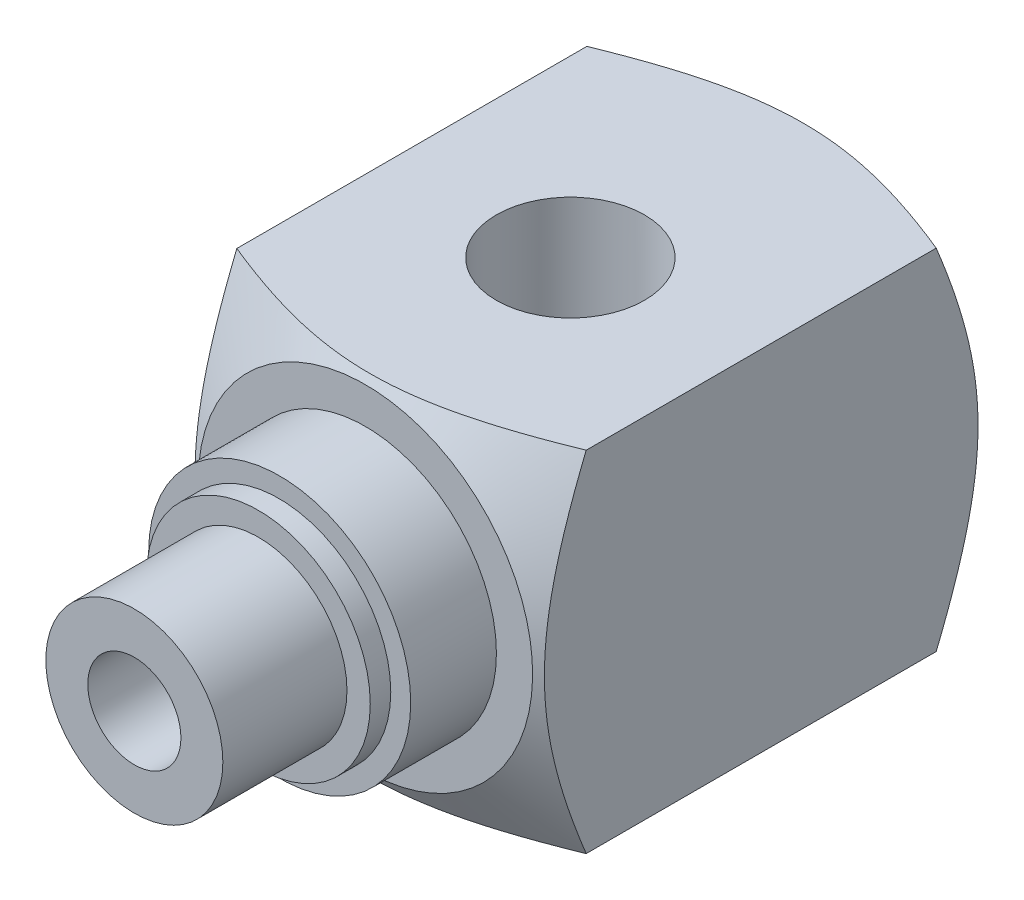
ISO-10303-21;
HEADER;
FILE_DESCRIPTION(('STEP AP214'),'2;1');
FILE_NAME('part.step','',(''),(''),'','','');
FILE_SCHEMA(('AUTOMOTIVE_DESIGN { 1 0 10303 214 1 1 1 1 }'));
ENDSEC;
DATA;
#1=APPLICATION_CONTEXT('core data for automotive mechanical design processes');
#2=APPLICATION_PROTOCOL_DEFINITION('international standard','automotive_design',2000,#1);
#3=PRODUCT_CONTEXT('',#1,'mechanical');
#4=PRODUCT('Part','Part','',(#3));
#5=PRODUCT_RELATED_PRODUCT_CATEGORY('part','',(#4));
#6=PRODUCT_DEFINITION_FORMATION('','',#4);
#7=PRODUCT_DEFINITION_CONTEXT('part definition',#1,'design');
#8=PRODUCT_DEFINITION('design','',#6,#7);
#9=PRODUCT_DEFINITION_SHAPE('','',#8);
#10=(LENGTH_UNIT() NAMED_UNIT(*) SI_UNIT(.MILLI.,.METRE.));
#11=(NAMED_UNIT(*) PLANE_ANGLE_UNIT() SI_UNIT($,.RADIAN.));
#12=(NAMED_UNIT(*) SI_UNIT($,.STERADIAN.) SOLID_ANGLE_UNIT());
#13=UNCERTAINTY_MEASURE_WITH_UNIT(LENGTH_MEASURE(1.E-05),#10,'distance_accuracy_value','');
#14=(GEOMETRIC_REPRESENTATION_CONTEXT(3) GLOBAL_UNCERTAINTY_ASSIGNED_CONTEXT((#13)) GLOBAL_UNIT_ASSIGNED_CONTEXT((#10,
#11,#12)) REPRESENTATION_CONTEXT('',''));
#15=CARTESIAN_POINT('',(0.,0.,0.));
#16=DIRECTION('',(0.,0.,1.));
#17=DIRECTION('',(1.,0.,0.));
#18=AXIS2_PLACEMENT_3D('',#15,#16,#17);
#19=CARTESIAN_POINT('',(0.,-1.76395366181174,-3.38391978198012));
#20=DIRECTION('',(0.,0.,1.));
#21=DIRECTION('',(-1.,0.,0.));
#22=AXIS2_PLACEMENT_3D('',#19,#20,#21);
#23=PLANE('',#22);
#24=CARTESIAN_POINT('',(0.,0.,-3.38391978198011));
#25=DIRECTION('',(0.,0.,1.));
#26=DIRECTION('',(-1.,0.,0.));
#27=AXIS2_PLACEMENT_3D('',#24,#25,#26);
#28=CIRCLE('',#27,1.81151829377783);
#29=CARTESIAN_POINT('',(-1.81151829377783,0.,-3.38391978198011));
#30=VERTEX_POINT('',#29);
#31=EDGE_CURVE('E224',#30,#30,#28,.F.);
#32=ORIENTED_EDGE('',*,*,#31,.F.);
#33=EDGE_LOOP('',(#32));
#34=FACE_BOUND('',#33,.T.);
#35=CARTESIAN_POINT('',(0.,0.,-3.38391978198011));
#36=DIRECTION('',(0.,0.,1.));
#37=DIRECTION('',(-1.,0.,0.));
#38=AXIS2_PLACEMENT_3D('',#35,#36,#37);
#39=CIRCLE('',#38,1.905);
#40=CARTESIAN_POINT('',(-1.905,0.,-3.38391978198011));
#41=VERTEX_POINT('',#40);
#42=EDGE_CURVE('E10',#41,#41,#39,.T.);
#43=ORIENTED_EDGE('',*,*,#42,.F.);
#44=EDGE_LOOP('',(#43));
#45=FACE_BOUND('',#44,.T.);
#46=ADVANCED_FACE('F15',(#34,#45),#23,.F.);
#47=CARTESIAN_POINT('',(0.,0.,0.));
#48=DIRECTION('',(0.,0.,1.));
#49=DIRECTION('',(-1.,0.,0.));
#50=AXIS2_PLACEMENT_3D('',#47,#48,#49);
#51=CYLINDRICAL_SURFACE('',#50,1.81151829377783);
#52=CARTESIAN_POINT('',(0.,0.,-3.9624));
#53=DIRECTION('',(0.,0.,1.));
#54=DIRECTION('',(-1.,0.,0.));
#55=AXIS2_PLACEMENT_3D('',#52,#53,#54);
#56=CIRCLE('',#55,1.81151829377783);
#57=CARTESIAN_POINT('',(-1.81151829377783,0.,-3.9624));
#58=VERTEX_POINT('',#57);
#59=EDGE_CURVE('E232',#58,#58,#56,.F.);
#60=ORIENTED_EDGE('',*,*,#59,.F.);
#61=EDGE_LOOP('',(#60));
#62=FACE_BOUND('',#61,.T.);
#63=ORIENTED_EDGE('',*,*,#31,.T.);
#64=EDGE_LOOP('',(#63));
#65=FACE_BOUND('',#64,.T.);
#66=ADVANCED_FACE('F169',(#62,#65),#51,.T.);
#67=CARTESIAN_POINT('',(0.,0.,-11.8872));
#68=DIRECTION('',(0.,0.,-1.));
#69=DIRECTION('',(1.,0.,0.));
#70=AXIS2_PLACEMENT_3D('',#67,#68,#69);
#71=CYLINDRICAL_SURFACE('',#70,1.27);
#72=CARTESIAN_POINT('',(0.,0.,0.));
#73=DIRECTION('',(0.,0.,-1.));
#74=DIRECTION('',(1.,0.,0.));
#75=AXIS2_PLACEMENT_3D('',#72,#73,#74);
#76=CIRCLE('',#75,1.27);
#77=CARTESIAN_POINT('',(1.27,0.,0.));
#78=VERTEX_POINT('',#77);
#79=EDGE_CURVE('E229',#78,#78,#76,.F.);
#80=ORIENTED_EDGE('',*,*,#79,.T.);
#81=EDGE_LOOP('',(#80));
#82=FACE_BOUND('',#81,.T.);
#83=CARTESIAN_POINT('',(-1.27,0.,-10.317272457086));
#84=CARTESIAN_POINT('',(-1.26999428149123,-0.0630105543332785,-10.3172633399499));
#85=CARTESIAN_POINT('',(-1.26526764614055,-0.126115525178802,-10.313407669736));
#86=CARTESIAN_POINT('',(-1.24670301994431,-0.250186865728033,-10.2986683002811));
#87=CARTESIAN_POINT('',(-1.23284095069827,-0.311147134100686,-10.2877660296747));
#88=CARTESIAN_POINT('',(-1.19700303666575,-0.428757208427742,-10.2607777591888));
#89=CARTESIAN_POINT('',(-1.17509828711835,-0.485439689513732,-10.2447373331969));
#90=CARTESIAN_POINT('',(-1.12400352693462,-0.594250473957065,-10.2093583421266));
#91=CARTESIAN_POINT('',(-1.09481315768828,-0.646378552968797,-10.1900196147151));
#92=CARTESIAN_POINT('',(-1.02534936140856,-0.752398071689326,-10.1470518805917));
#93=CARTESIAN_POINT('',(-0.984108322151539,-0.805564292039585,-10.1231971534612));
#94=CARTESIAN_POINT('',(-0.89368743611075,-0.904840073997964,-10.0757066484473));
#95=CARTESIAN_POINT('',(-0.844500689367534,-0.950943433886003,-10.0520710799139));
#96=CARTESIAN_POINT('',(-0.732279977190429,-1.04039544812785,-10.0042512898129));
#97=CARTESIAN_POINT('',(-0.668287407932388,-1.0827114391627,-9.98035579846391));
#98=CARTESIAN_POINT('',(-0.532300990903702,-1.15563338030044,-9.93802585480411));
#99=CARTESIAN_POINT('',(-0.460315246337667,-1.18625105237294,-9.91958594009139));
#100=CARTESIAN_POINT('',(-0.318180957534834,-1.23151835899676,-9.89194959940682));
#101=CARTESIAN_POINT('',(-0.248602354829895,-1.24748450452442,-9.88199862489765));
#102=CARTESIAN_POINT('',(-0.107123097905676,-1.26748257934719,-9.86949826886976));
#103=CARTESIAN_POINT('',(-0.0352250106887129,-1.27152727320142,-9.86694097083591));
#104=CARTESIAN_POINT('',(0.0982914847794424,-1.26770768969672,-9.8693403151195));
#105=CARTESIAN_POINT('',(0.159979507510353,-1.26138658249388,-9.87332339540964));
#106=CARTESIAN_POINT('',(0.281214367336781,-1.24000262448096,-9.8866478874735));
#107=CARTESIAN_POINT('',(0.340761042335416,-1.22493911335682,-9.89598970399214));
#108=CARTESIAN_POINT('',(0.456359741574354,-1.18674048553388,-9.91925780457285));
#109=CARTESIAN_POINT('',(0.512404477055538,-1.1635891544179,-9.93319329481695));
#110=CARTESIAN_POINT('',(0.619853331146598,-1.11008458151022,-9.96457385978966));
#111=CARTESIAN_POINT('',(0.671256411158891,-1.07972973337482,-9.9820197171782));
#112=CARTESIAN_POINT('',(0.774868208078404,-1.00842227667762,-10.0215639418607));
#113=CARTESIAN_POINT('',(0.82637230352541,-0.966618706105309,-10.0439713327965));
#114=CARTESIAN_POINT('',(0.922085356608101,-0.875797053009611,-10.0899361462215));
#115=CARTESIAN_POINT('',(0.966283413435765,-0.826768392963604,-10.1134952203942));
#116=CARTESIAN_POINT('',(1.0521066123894,-0.715236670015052,-10.1628441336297));
#117=CARTESIAN_POINT('',(1.0926088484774,-0.651808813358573,-10.18851424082));
#118=CARTESIAN_POINT('',(1.16223394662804,-0.517500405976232,-10.2353673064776));
#119=CARTESIAN_POINT('',(1.19137769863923,-0.446633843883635,-10.2565584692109));
#120=CARTESIAN_POINT('',(1.23069996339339,-0.31858471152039,-10.2861416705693));
#121=CARTESIAN_POINT('',(1.2438587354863,-0.262759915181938,-10.2964378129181));
#122=CARTESIAN_POINT('',(1.26252376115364,-0.149122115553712,-10.3112072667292));
#123=CARTESIAN_POINT('',(1.26804072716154,-0.0913120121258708,-10.315688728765));
#124=CARTESIAN_POINT('',(1.27108841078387,0.0248045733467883,-10.3181518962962));
#125=CARTESIAN_POINT('',(1.26859952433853,0.0831119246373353,-10.3161176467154));
#126=CARTESIAN_POINT('',(1.25576194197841,0.198311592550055,-10.3058405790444));
#127=CARTESIAN_POINT('',(1.24540670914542,0.255202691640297,-10.2975925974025));
#128=CARTESIAN_POINT('',(1.2176969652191,0.36505636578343,-10.2762745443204));
#129=CARTESIAN_POINT('',(1.20048038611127,0.418073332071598,-10.2632999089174));
#130=CARTESIAN_POINT('',(1.15971474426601,0.52058472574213,-10.2339414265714));
#131=CARTESIAN_POINT('',(1.13616344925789,0.570077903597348,-10.217556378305));
#132=CARTESIAN_POINT('',(1.0782075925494,0.674217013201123,-10.1794353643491));
#133=CARTESIAN_POINT('',(1.04258788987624,0.728031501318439,-10.1572757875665));
#134=CARTESIAN_POINT('',(0.96381302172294,0.82951637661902,-10.1121783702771));
#135=CARTESIAN_POINT('',(0.920649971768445,0.877180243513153,-10.0892397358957));
#136=CARTESIAN_POINT('',(0.81957758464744,0.973041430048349,-10.0407165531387));
#137=CARTESIAN_POINT('',(0.760410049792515,1.02002367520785,-10.0153216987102));
#138=CARTESIAN_POINT('',(0.633508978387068,1.1033203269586,-9.96865883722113));
#139=CARTESIAN_POINT('',(0.565779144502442,1.13963932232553,-9.9473890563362));
#140=CARTESIAN_POINT('',(0.42741109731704,1.19813595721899,-9.91243801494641));
#141=CARTESIAN_POINT('',(0.357160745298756,1.22100355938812,-9.89839233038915));
#142=CARTESIAN_POINT('',(0.212734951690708,1.25423763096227,-9.87781946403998));
#143=CARTESIAN_POINT('',(0.138565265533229,1.26462192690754,-9.87128156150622));
#144=CARTESIAN_POINT('',(0.000517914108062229,1.27159128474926,-9.86689921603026));
#145=CARTESIAN_POINT('',(-0.0632379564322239,1.27000970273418,-9.86789967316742));
#146=CARTESIAN_POINT('',(-0.189426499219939,1.25739225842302,-9.87581172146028));
#147=CARTESIAN_POINT('',(-0.251859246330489,1.24635693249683,-9.88272297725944));
#148=CARTESIAN_POINT('',(-0.371295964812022,1.21601647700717,-9.90144239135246));
#149=CARTESIAN_POINT('',(-0.428416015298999,1.19704072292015,-9.91305497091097));
#150=CARTESIAN_POINT('',(-0.538603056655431,1.15167682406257,-9.94022732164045));
#151=CARTESIAN_POINT('',(-0.591669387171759,1.12528747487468,-9.95578773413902));
#152=CARTESIAN_POINT('',(-0.698158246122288,1.06285817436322,-9.9915161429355));
#153=CARTESIAN_POINT('',(-0.751057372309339,1.02610533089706,-10.0119932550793));
#154=CARTESIAN_POINT('',(-0.850311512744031,0.945497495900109,-10.0548593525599));
#155=CARTESIAN_POINT('',(-0.896659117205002,0.9016345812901,-10.077250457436));
#156=CARTESIAN_POINT('',(-0.988536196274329,0.800636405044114,-10.1255424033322));
#157=CARTESIAN_POINT('',(-1.0329506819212,0.742498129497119,-10.1514767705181));
#158=CARTESIAN_POINT('',(-1.11155313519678,0.61864234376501,-10.2007319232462));
#159=CARTESIAN_POINT('',(-1.14574620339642,0.55292863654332,-10.224054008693));
#160=CARTESIAN_POINT('',(-1.19639258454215,0.430052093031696,-10.2602499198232));
#161=CARTESIAN_POINT('',(-1.21508980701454,0.37415985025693,-10.274293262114));
#162=CARTESIAN_POINT('',(-1.24463420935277,0.259368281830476,-10.2969758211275));
#163=CARTESIAN_POINT('',(-1.25550588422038,0.200478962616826,-10.3056318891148));
#164=CARTESIAN_POINT('',(-1.26476642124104,0.117559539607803,-10.3130505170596));
#165=CARTESIAN_POINT('',(-1.26672554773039,0.0941250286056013,-10.3146281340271));
#166=CARTESIAN_POINT('',(-1.26934357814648,0.0471314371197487,-10.3167409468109));
#167=CARTESIAN_POINT('',(-1.27000213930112,0.0235723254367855,-10.3172758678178));
#168=CARTESIAN_POINT('',(-1.27,0.,-10.317272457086));
#169=B_SPLINE_CURVE_WITH_KNOTS('',3,(#83,#84,#85,#86,#87,#88,#89,#90,#91,#92,#93,#94,#95,#96,
#97,#98,#99,#100,#101,#102,#103,#104,#105,#106,#107,#108,#109,#110,#111,#112,#113,#114,#115,
#116,#117,#118,#119,#120,#121,#122,#123,#124,#125,#126,#127,#128,#129,#130,#131,#132,#133,#134,
#135,#136,#137,#138,#139,#140,#141,#142,#143,#144,#145,#146,#147,#148,#149,#150,#151,#152,#153,
#154,#155,#156,#157,#158,#159,#160,#161,#162,#163,#164,#165,#166,#167,#168),.UNSPECIFIED.,.T.,
.F.,(4,2,2,2,2,2,2,2,2,2,2,2,2,2,2,2,2,2,2,2,2,2,2,2,2,2,2,2,2,2,2,2,2,2,2,2,2,2,2,2,2,2,4),(0.,
0.188923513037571,0.378346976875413,0.566134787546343,0.753931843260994,0.96728253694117,
1.18081950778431,1.42056598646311,1.66007159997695,1.87499168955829,2.08968157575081,
2.27520619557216,2.46074482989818,2.64665758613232,2.83261183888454,3.04184358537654,
3.25138474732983,3.48877863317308,3.72573383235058,3.89982225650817,4.07366639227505,
4.24793654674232,4.42235167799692,4.59342444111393,4.76455756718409,4.96850195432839,
5.17266079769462,5.41057892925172,5.64839452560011,5.87260928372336,6.09650347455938,
6.28687392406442,6.47723357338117,6.66037652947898,6.84354925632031,7.04553864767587,
7.2477546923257,7.4796011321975,7.71133168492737,7.89241028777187,8.07291959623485,
8.143577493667,8.21425401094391),.UNSPECIFIED.);
#170=CARTESIAN_POINT('',(-1.27,0.,-10.317272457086));
#171=VERTEX_POINT('',#170);
#172=EDGE_CURVE('E287',#171,#171,#169,.T.);
#173=ORIENTED_EDGE('',*,*,#172,.F.);
#174=EDGE_LOOP('',(#173));
#175=FACE_BOUND('',#174,.T.);
#176=ADVANCED_FACE('F172',(#82,#175),#71,.F.);
#177=CARTESIAN_POINT('',(0.,0.,0.));
#178=DIRECTION('',(0.,0.,-1.));
#179=DIRECTION('',(1.,0.,0.));
#180=AXIS2_PLACEMENT_3D('',#177,#178,#179);
#181=PLANE('',#180);
#182=CARTESIAN_POINT('',(0.,0.,-1.03406866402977E-11));
#183=DIRECTION('',(0.,0.,-1.));
#184=DIRECTION('',(1.,0.,0.));
#185=AXIS2_PLACEMENT_3D('',#182,#183,#184);
#186=CIRCLE('',#185,2.413);
#187=CARTESIAN_POINT('',(2.413,0.,-1.03406866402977E-11));
#188=VERTEX_POINT('',#187);
#189=EDGE_CURVE('E228',#188,#188,#186,.T.);
#190=ORIENTED_EDGE('',*,*,#189,.F.);
#191=EDGE_LOOP('',(#190));
#192=FACE_BOUND('',#191,.T.);
#193=ORIENTED_EDGE('',*,*,#79,.F.);
#194=EDGE_LOOP('',(#193));
#195=FACE_BOUND('',#194,.T.);
#196=ADVANCED_FACE('F167',(#192,#195),#181,.F.);
#197=CARTESIAN_POINT('',(0.,0.,-3.9624));
#198=DIRECTION('',(0.,0.,1.));
#199=DIRECTION('',(-1.,0.,0.));
#200=AXIS2_PLACEMENT_3D('',#197,#198,#199);
#201=PLANE('',#200);
#202=ORIENTED_EDGE('',*,*,#59,.T.);
#203=EDGE_LOOP('',(#202));
#204=FACE_BOUND('',#203,.T.);
#205=CARTESIAN_POINT('',(0.,0.,-3.9624));
#206=DIRECTION('',(0.,0.,-1.));
#207=DIRECTION('',(1.,0.,0.));
#208=AXIS2_PLACEMENT_3D('',#205,#206,#207);
#209=CIRCLE('',#208,3.571875);
#210=CARTESIAN_POINT('',(3.571875,0.,-3.9624));
#211=VERTEX_POINT('',#210);
#212=EDGE_CURVE('E235',#211,#211,#209,.T.);
#213=ORIENTED_EDGE('',*,*,#212,.F.);
#214=EDGE_LOOP('',(#213));
#215=FACE_BOUND('',#214,.T.);
#216=ADVANCED_FACE('F163',(#204,#215),#201,.T.);
#217=CARTESIAN_POINT('',(0.,0.,-3.9624));
#218=DIRECTION('',(0.,0.,-1.));
#219=DIRECTION('',(1.,0.,0.));
#220=AXIS2_PLACEMENT_3D('',#217,#218,#219);
#221=CYLINDRICAL_SURFACE('',#220,3.571875);
#222=CARTESIAN_POINT('',(0.,0.,-6.2992));
#223=DIRECTION('',(0.,0.,1.));
#224=DIRECTION('',(-1.,0.,0.));
#225=AXIS2_PLACEMENT_3D('',#222,#223,#224);
#226=CIRCLE('',#225,3.571875);
#227=CARTESIAN_POINT('',(-3.571875,0.,-6.2992));
#228=VERTEX_POINT('',#227);
#229=EDGE_CURVE('E19',#228,#228,#226,.F.);
#230=ORIENTED_EDGE('',*,*,#229,.F.);
#231=EDGE_LOOP('',(#230));
#232=FACE_BOUND('',#231,.T.);
#233=ORIENTED_EDGE('',*,*,#212,.T.);
#234=EDGE_LOOP('',(#233));
#235=FACE_BOUND('',#234,.T.);
#236=ADVANCED_FACE('F158',(#232,#235),#221,.T.);
#237=CARTESIAN_POINT('',(0.,1.19348832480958E-13,-17.091432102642));
#238=DIRECTION('',(0.,0.,1.));
#239=DIRECTION('',(-1.,0.,0.));
#240=AXIS2_PLACEMENT_3D('',#237,#238,#239);
#241=CONICAL_SURFACE('',#240,6.74702821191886,1.04719755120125);
#242=CARTESIAN_POINT('',(0.,1.2734968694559E-13,-18.2372000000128));
#243=DIRECTION('',(0.,0.,1.));
#244=DIRECTION('',(-1.,0.,0.));
#245=AXIS2_PLACEMENT_3D('',#242,#243,#244);
#246=CIRCLE('',#245,4.76249999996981);
#247=CARTESIAN_POINT('',(-4.7624999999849,1.27495496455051E-13,-18.2372000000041));
#248=VERTEX_POINT('',#247);
#249=CARTESIAN_POINT('',(0.,-4.76249999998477,-18.2372000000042));
#250=VERTEX_POINT('',#249);
#251=EDGE_CURVE('E60',#248,#250,#246,.T.);
#252=ORIENTED_EDGE('',*,*,#251,.T.);
#253=CARTESIAN_POINT('',(-4.76250000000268,-4.76249999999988,-17.0982656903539));
#254=CARTESIAN_POINT('',(-4.57208671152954,-4.76249999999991,-17.1759549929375));
#255=CARTESIAN_POINT('',(-4.38085979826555,-4.76249999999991,-17.2517357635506));
#256=CARTESIAN_POINT('',(-3.99641044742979,-4.76249999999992,-17.3983498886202));
#257=CARTESIAN_POINT('',(-3.8031870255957,-4.76249999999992,-17.4691806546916));
#258=CARTESIAN_POINT('',(-3.41641730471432,-4.76249999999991,-17.6040384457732));
#259=CARTESIAN_POINT('',(-3.22289146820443,-4.76249999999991,-17.6681236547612));
#260=CARTESIAN_POINT('',(-2.83348837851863,-4.76249999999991,-17.7887551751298));
#261=CARTESIAN_POINT('',(-2.63761119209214,-4.76249999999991,-17.8453016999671));
#262=CARTESIAN_POINT('',(-2.24231011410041,-4.76249999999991,-17.9493829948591));
#263=CARTESIAN_POINT('',(-2.04287271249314,-4.76249999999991,-17.9968669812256));
#264=CARTESIAN_POINT('',(-1.64164444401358,-4.76249999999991,-18.0804312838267));
#265=CARTESIAN_POINT('',(-1.43985448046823,-4.76249999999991,-18.1165158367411));
#266=CARTESIAN_POINT('',(-1.13480263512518,-4.76249999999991,-18.1607994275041));
#267=CARTESIAN_POINT('',(-1.03224756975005,-4.76249999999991,-18.173957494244));
#268=CARTESIAN_POINT('',(-0.826738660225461,-4.76249999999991,-18.1966851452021));
#269=CARTESIAN_POINT('',(-0.723784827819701,-4.76249999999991,-18.2062548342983));
#270=CARTESIAN_POINT('',(-0.517439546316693,-4.76249999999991,-18.2216494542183));
#271=CARTESIAN_POINT('',(-0.414047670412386,-4.76249999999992,-18.2274686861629));
#272=CARTESIAN_POINT('',(-0.207105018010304,-4.76249999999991,-18.2352503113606));
#273=CARTESIAN_POINT('',(-0.103554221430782,-4.7624999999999,-18.2372121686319));
#274=CARTESIAN_POINT('',(0.,-4.76249999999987,-18.2371999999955));
#275=B_SPLINE_CURVE_WITH_KNOTS('',3,(#253,#254,#255,#256,#257,#258,#259,#260,#261,#262,#263,
#264,#265,#266,#267,#268,#269,#270,#271,#272,#273,#274),.UNSPECIFIED.,.F.,.F.,(4,2,2,2,2,2,2,2,
2,2,4),(0.,0.616995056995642,1.2343103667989,1.84576786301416,2.45720804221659,3.07197993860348,
3.68652308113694,3.9966573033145,4.30678246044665,4.61737775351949,4.92801620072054),.UNSPECIFIED.);
#276=CARTESIAN_POINT('',(-4.76250000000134,-4.76250000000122,-17.0982656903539));
#277=VERTEX_POINT('',#276);
#278=EDGE_CURVE('E140',#277,#250,#275,.T.);
#279=ORIENTED_EDGE('',*,*,#278,.F.);
#280=CARTESIAN_POINT('',(-4.7625,1.27641305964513E-13,-18.2371999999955));
#281=CARTESIAN_POINT('',(-4.7625,-0.137484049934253,-18.2372366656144));
#282=CARTESIAN_POINT('',(-4.7625,-0.274955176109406,-18.2337636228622));
#283=CARTESIAN_POINT('',(-4.7625,-0.549509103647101,-18.2200738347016));
#284=CARTESIAN_POINT('',(-4.7625,-0.686592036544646,-18.209859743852));
#285=CARTESIAN_POINT('',(-4.7625,-0.959687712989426,-18.183005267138));
#286=CARTESIAN_POINT('',(-4.7625,-1.09570246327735,-18.1663850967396));
#287=CARTESIAN_POINT('',(-4.7625,-1.36687340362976,-18.1271968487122));
#288=CARTESIAN_POINT('',(-4.7625,-1.50202951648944,-18.1046282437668));
#289=CARTESIAN_POINT('',(-4.7625,-1.90316514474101,-18.0293569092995));
#290=CARTESIAN_POINT('',(-4.7625,-2.16768005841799,-17.9687837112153));
#291=CARTESIAN_POINT('',(-4.7625,-2.69245363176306,-17.8311017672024));
#292=CARTESIAN_POINT('',(-4.7625,-2.95270897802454,-17.7539807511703));
#293=CARTESIAN_POINT('',(-4.7625,-3.34177693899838,-17.6284003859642));
#294=CARTESIAN_POINT('',(-4.7625,-3.4721122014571,-17.5845640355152));
#295=CARTESIAN_POINT('',(-4.7625,-3.7317703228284,-17.4941341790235));
#296=CARTESIAN_POINT('',(-4.7625,-3.86109353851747,-17.4475416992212));
#297=CARTESIAN_POINT('',(-4.7625,-4.11955360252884,-17.351712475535));
#298=CARTESIAN_POINT('',(-4.7625,-4.24868560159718,-17.3024627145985));
#299=CARTESIAN_POINT('',(-4.7625,-4.50616757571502,-17.2018595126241));
#300=CARTESIAN_POINT('',(-4.7625,-4.63451733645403,-17.1505055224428));
#301=CARTESIAN_POINT('',(-4.7625,-4.76250000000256,-17.0982656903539));
#302=B_SPLINE_CURVE_WITH_KNOTS('',3,(#280,#281,#282,#283,#284,#285,#286,#287,#288,#289,#290,
#291,#292,#293,#294,#295,#296,#297,#298,#299,#300,#301),.UNSPECIFIED.,.F.,.F.,(4,2,2,2,2,2,2,2,
2,2,4),(0.,0.412387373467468,0.824612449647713,1.23554719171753,1.64651837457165,
2.45983511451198,3.27375702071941,3.6862606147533,4.09861156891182,4.51320785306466,
4.92791303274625),.UNSPECIFIED.);
#303=EDGE_CURVE('E148',#248,#277,#302,.T.);
#304=ORIENTED_EDGE('',*,*,#303,.F.);
#305=EDGE_LOOP('',(#252,#279,#304));
#306=FACE_BOUND('',#305,.T.);
#307=ADVANCED_FACE('F153',(#306),#241,.T.);
#308=CARTESIAN_POINT('',(4.7625,-4.76249999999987,-18.2372));
#309=DIRECTION('',(0.,0.,1.));
#310=DIRECTION('',(-1.,0.,0.));
#311=AXIS2_PLACEMENT_3D('',#308,#309,#310);
#312=PLANE('',#311);
#313=CARTESIAN_POINT('',(0.,1.2734968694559E-13,-18.2372000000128));
#314=DIRECTION('',(0.,0.,1.));
#315=DIRECTION('',(-1.,0.,0.));
#316=AXIS2_PLACEMENT_3D('',#313,#314,#315);
#317=CIRCLE('',#316,4.76249999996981);
#318=CARTESIAN_POINT('',(0.,4.76249999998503,-18.2372000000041));
#319=VERTEX_POINT('',#318);
#320=EDGE_CURVE('E79',#319,#248,#317,.T.);
#321=ORIENTED_EDGE('',*,*,#320,.F.);
#322=CARTESIAN_POINT('',(0.,1.2734968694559E-13,-18.2372000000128));
#323=DIRECTION('',(0.,0.,1.));
#324=DIRECTION('',(-1.,0.,0.));
#325=AXIS2_PLACEMENT_3D('',#322,#323,#324);
#326=CIRCLE('',#325,4.76249999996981);
#327=CARTESIAN_POINT('',(4.7624999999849,1.2691225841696E-13,-18.2372000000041));
#328=VERTEX_POINT('',#327);
#329=EDGE_CURVE('E74',#328,#319,#326,.T.);
#330=ORIENTED_EDGE('',*,*,#329,.F.);
#331=CARTESIAN_POINT('',(0.,1.2734968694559E-13,-18.2372000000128));
#332=DIRECTION('',(0.,0.,1.));
#333=DIRECTION('',(-1.,0.,0.));
#334=AXIS2_PLACEMENT_3D('',#331,#332,#333);
#335=CIRCLE('',#334,4.76249999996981);
#336=EDGE_CURVE('E77',#250,#328,#335,.T.);
#337=ORIENTED_EDGE('',*,*,#336,.F.);
#338=ORIENTED_EDGE('',*,*,#251,.F.);
#339=EDGE_LOOP('',(#321,#330,#337,#338));
#340=FACE_BOUND('',#339,.T.);
#341=ADVANCED_FACE('F76',(#340),#312,.F.);
#342=CARTESIAN_POINT('',(0.,1.19348832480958E-13,-17.091432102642));
#343=DIRECTION('',(0.,0.,1.));
#344=DIRECTION('',(-1.,0.,0.));
#345=AXIS2_PLACEMENT_3D('',#342,#343,#344);
#346=CONICAL_SURFACE('',#345,6.74702821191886,1.04719755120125);
#347=ORIENTED_EDGE('',*,*,#320,.T.);
#348=CARTESIAN_POINT('',(-4.7625,4.7625000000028,-17.0982656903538));
#349=CARTESIAN_POINT('',(-4.7625,4.57208671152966,-17.1759549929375));
#350=CARTESIAN_POINT('',(-4.7625,4.38085979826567,-17.2517357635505));
#351=CARTESIAN_POINT('',(-4.7625,3.99641044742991,-17.3983498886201));
#352=CARTESIAN_POINT('',(-4.7625,3.80318702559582,-17.4691806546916));
#353=CARTESIAN_POINT('',(-4.7625,3.41641730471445,-17.6040384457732));
#354=CARTESIAN_POINT('',(-4.7625,3.22289146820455,-17.6681236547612));
#355=CARTESIAN_POINT('',(-4.7625,2.83348837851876,-17.7887551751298));
#356=CARTESIAN_POINT('',(-4.7625,2.63761119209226,-17.8453016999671));
#357=CARTESIAN_POINT('',(-4.7625,2.24231011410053,-17.9493829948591));
#358=CARTESIAN_POINT('',(-4.7625,2.04287271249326,-17.9968669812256));
#359=CARTESIAN_POINT('',(-4.7625,1.6416444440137,-18.0804312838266));
#360=CARTESIAN_POINT('',(-4.7625,1.43985448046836,-18.1165158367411));
#361=CARTESIAN_POINT('',(-4.7625,1.1348026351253,-18.160799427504));
#362=CARTESIAN_POINT('',(-4.7625,1.03224756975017,-18.173957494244));
#363=CARTESIAN_POINT('',(-4.7625,0.826738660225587,-18.1966851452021));
#364=CARTESIAN_POINT('',(-4.7625,0.723784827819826,-18.2062548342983));
#365=CARTESIAN_POINT('',(-4.7625,0.517439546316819,-18.2216494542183));
#366=CARTESIAN_POINT('',(-4.7625,0.414047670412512,-18.2274686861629));
#367=CARTESIAN_POINT('',(-4.7625,0.20710501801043,-18.2352503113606));
#368=CARTESIAN_POINT('',(-4.7625,0.103554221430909,-18.2372121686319));
#369=CARTESIAN_POINT('',(-4.7625,1.28409825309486E-13,-18.2371999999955));
#370=B_SPLINE_CURVE_WITH_KNOTS('',3,(#348,#349,#350,#351,#352,#353,#354,#355,#356,#357,#358,
#359,#360,#361,#362,#363,#364,#365,#366,#367,#368,#369),.UNSPECIFIED.,.F.,.F.,(4,2,2,2,2,2,2,2,
2,2,4),(0.,0.616995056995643,1.2343103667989,1.84576786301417,2.45720804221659,3.07197993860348,
3.68652308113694,3.9966573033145,4.30678246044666,4.61737775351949,4.92801620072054),.UNSPECIFIED.);
#371=CARTESIAN_POINT('',(-4.7625,4.76250000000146,-17.0982656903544));
#372=VERTEX_POINT('',#371);
#373=EDGE_CURVE('E239',#372,#248,#370,.T.);
#374=ORIENTED_EDGE('',*,*,#373,.F.);
#375=CARTESIAN_POINT('',(0.,4.76250000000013,-18.2371999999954));
#376=CARTESIAN_POINT('',(-0.137484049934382,4.7625000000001,-18.2372366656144));
#377=CARTESIAN_POINT('',(-0.274955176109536,4.76250000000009,-18.2337636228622));
#378=CARTESIAN_POINT('',(-0.549509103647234,4.76250000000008,-18.2200738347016));
#379=CARTESIAN_POINT('',(-0.686592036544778,4.76250000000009,-18.209859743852));
#380=CARTESIAN_POINT('',(-0.959687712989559,4.76250000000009,-18.1830052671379));
#381=CARTESIAN_POINT('',(-1.09570246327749,4.76250000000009,-18.1663850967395));
#382=CARTESIAN_POINT('',(-1.3668734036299,4.76250000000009,-18.1271968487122));
#383=CARTESIAN_POINT('',(-1.50202951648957,4.76250000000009,-18.1046282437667));
#384=CARTESIAN_POINT('',(-1.90316514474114,4.76250000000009,-18.0293569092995));
#385=CARTESIAN_POINT('',(-2.16768005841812,4.76250000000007,-17.9687837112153));
#386=CARTESIAN_POINT('',(-2.69245363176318,4.7625000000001,-17.8311017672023));
#387=CARTESIAN_POINT('',(-2.95270897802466,4.76250000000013,-17.7539807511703));
#388=CARTESIAN_POINT('',(-3.3417769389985,4.76250000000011,-17.6284003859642));
#389=CARTESIAN_POINT('',(-3.47211220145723,4.76250000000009,-17.5845640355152));
#390=CARTESIAN_POINT('',(-3.73177032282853,4.76250000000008,-17.4941341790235));
#391=CARTESIAN_POINT('',(-3.8610935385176,4.76250000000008,-17.4475416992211));
#392=CARTESIAN_POINT('',(-4.11955360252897,4.76250000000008,-17.3517124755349));
#393=CARTESIAN_POINT('',(-4.2486856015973,4.76250000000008,-17.3024627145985));
#394=CARTESIAN_POINT('',(-4.50616757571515,4.76250000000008,-17.201859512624));
#395=CARTESIAN_POINT('',(-4.63451733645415,4.76250000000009,-17.1505055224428));
#396=CARTESIAN_POINT('',(-4.76250000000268,4.76250000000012,-17.0982656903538));
#397=B_SPLINE_CURVE_WITH_KNOTS('',3,(#375,#376,#377,#378,#379,#380,#381,#382,#383,#384,#385,
#386,#387,#388,#389,#390,#391,#392,#393,#394,#395,#396),.UNSPECIFIED.,.F.,.F.,(4,2,2,2,2,2,2,2,
2,2,4),(0.,0.412387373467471,0.824612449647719,1.23554719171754,1.64651837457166,
2.45983511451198,3.27375702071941,3.68626061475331,4.09861156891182,4.51320785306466,
4.92791303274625),.UNSPECIFIED.);
#398=EDGE_CURVE('E117',#319,#372,#397,.T.);
#399=ORIENTED_EDGE('',*,*,#398,.F.);
#400=EDGE_LOOP('',(#347,#374,#399));
#401=FACE_BOUND('',#400,.T.);
#402=ADVANCED_FACE('F246',(#401),#346,.T.);
#403=CARTESIAN_POINT('',(-4.7625,-4.7625,-5.5372));
#404=DIRECTION('',(-1.,0.,0.));
#405=DIRECTION('',(0.,1.,0.));
#406=AXIS2_PLACEMENT_3D('',#403,#404,#405);
#407=PLANE('',#406);
#408=DIRECTION('',(0.,0.,-1.));
#409=VECTOR('',#408,1.);
#410=CARTESIAN_POINT('',(-4.7625,-4.7625,-5.5372));
#411=LINE('',#410,#409);
#412=CARTESIAN_POINT('',(-4.7625,-4.7625,-7.5560161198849));
#413=VERTEX_POINT('',#412);
#414=EDGE_CURVE('E147',#413,#277,#411,.T.);
#415=ORIENTED_EDGE('',*,*,#414,.F.);
#416=CARTESIAN_POINT('',(-4.76250000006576,722132.208680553,-416926.892533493));
#417=CARTESIAN_POINT('',(-4.76152293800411,-734069626.033258,-1522355001.15631));
#418=CARTESIAN_POINT('',(-4.76249999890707,249803.830270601,-121897.639485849));
#419=CARTESIAN_POINT('',(-4.7625,7.41524500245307,-8.75545987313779));
#420=CARTESIAN_POINT('',(-4.7625,7.3078770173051,-8.7034159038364));
#421=CARTESIAN_POINT('',(-4.7625,7.09287203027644,-8.5998897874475));
#422=CARTESIAN_POINT('',(-4.7625,6.98523503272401,-8.54840763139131));
#423=CARTESIAN_POINT('',(-4.7625,6.66188166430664,-8.39492044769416));
#424=CARTESIAN_POINT('',(-4.7625,6.44571112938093,-8.29386893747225));
#425=CARTESIAN_POINT('',(-4.7625,6.01174015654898,-8.09483031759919));
#426=CARTESIAN_POINT('',(-4.7625,5.79393850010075,-7.99684585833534));
#427=CARTESIAN_POINT('',(-4.7625,5.35658632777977,-7.80485098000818));
#428=CARTESIAN_POINT('',(-4.7625,5.13703582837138,-7.71084052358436));
#429=CARTESIAN_POINT('',(-4.7625,4.69788402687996,-7.52872858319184));
#430=CARTESIAN_POINT('',(-4.7625,4.47830227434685,-7.44058018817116));
#431=CARTESIAN_POINT('',(-4.7625,4.03665213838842,-7.27063722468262));
#432=CARTESIAN_POINT('',(-4.7625,3.81458351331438,-7.188843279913));
#433=CARTESIAN_POINT('',(-4.7625,3.36783972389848,-7.03355563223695));
#434=CARTESIAN_POINT('',(-4.7625,3.14316807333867,-6.9600519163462));
#435=CARTESIAN_POINT('',(-4.7625,2.69066965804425,-6.82360447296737));
#436=CARTESIAN_POINT('',(-4.7625,2.46284381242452,-6.76065773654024));
#437=CARTESIAN_POINT('',(-4.7625,2.00097036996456,-6.64744407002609));
#438=CARTESIAN_POINT('',(-4.7625,1.76688057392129,-6.59734616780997));
#439=CARTESIAN_POINT('',(-4.7625,1.29565480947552,-6.51408185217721));
#440=CARTESIAN_POINT('',(-4.7625,1.05851907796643,-6.4809141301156));
#441=CARTESIAN_POINT('',(-4.7625,0.583820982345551,-6.43439743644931));
#442=CARTESIAN_POINT('',(-4.7625,0.346271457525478,-6.4209207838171));
#443=CARTESIAN_POINT('',(-4.7625,-0.129106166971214,-6.41467195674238));
#444=CARTESIAN_POINT('',(-4.7625,-0.366934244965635,-6.42189826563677));
#445=CARTESIAN_POINT('',(-4.7625,-0.767070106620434,-6.45094372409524));
#446=CARTESIAN_POINT('',(-4.7625,-0.929786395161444,-6.46750576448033));
#447=CARTESIAN_POINT('',(-4.7625,-1.25410396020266,-6.50935252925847));
#448=CARTESIAN_POINT('',(-4.7625,-1.41570509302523,-6.53463835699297));
#449=CARTESIAN_POINT('',(-4.7625,-1.89858300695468,-6.62225568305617));
#450=CARTESIAN_POINT('',(-4.7625,-2.21774039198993,-6.69633096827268));
#451=CARTESIAN_POINT('',(-4.7625,-2.85312662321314,-6.86858737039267));
#452=CARTESIAN_POINT('',(-4.7625,-3.16928039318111,-6.96703413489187));
#453=CARTESIAN_POINT('',(-4.7625,-3.79575026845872,-7.18053473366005));
#454=CARTESIAN_POINT('',(-4.7625,-4.10606780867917,-7.2955844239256));
#455=CARTESIAN_POINT('',(-4.7625,-4.68556022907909,-7.52302469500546));
#456=CARTESIAN_POINT('',(-4.7625,-4.9552529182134,-7.63411479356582));
#457=CARTESIAN_POINT('',(-4.7625,-5.49178242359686,-7.86302112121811));
#458=CARTESIAN_POINT('',(-4.7625,-5.75861898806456,-7.98083793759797));
#459=CARTESIAN_POINT('',(-4.7625,-6.29006174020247,-8.22153925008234));
#460=CARTESIAN_POINT('',(-4.7625,-6.55466737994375,-8.34442494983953));
#461=CARTESIAN_POINT('',(-4.7625,-7.08205602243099,-8.59405047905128));
#462=CARTESIAN_POINT('',(-4.7625,-7.34483898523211,-8.72079039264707));
#463=CARTESIAN_POINT('',(-4.7625,-7.86748677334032,-8.97655176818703));
#464=CARTESIAN_POINT('',(-4.7625,-8.12735969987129,-9.10555671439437));
#465=CARTESIAN_POINT('',(-4.7625,-8.64593133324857,-9.36590575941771));
#466=CARTESIAN_POINT('',(-4.7625,-8.90463003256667,-9.4972498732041));
#467=CARTESIAN_POINT('',(-4.7625,-9.42101187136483,-9.7617844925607));
#468=CARTESIAN_POINT('',(-4.7625,-9.67869521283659,-9.89497460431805));
#469=CARTESIAN_POINT('',(-4.7625,-10.1932660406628,-10.1628789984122));
#470=CARTESIAN_POINT('',(-4.7625,-10.4501535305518,-10.2975932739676));
#471=CARTESIAN_POINT('',(-4.7625,-11.2193225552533,-10.703334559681));
#472=CARTESIAN_POINT('',(-4.7625,-11.7306217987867,-10.9762233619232));
#473=CARTESIAN_POINT('',(-4.7625,-12.7513636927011,-11.5254544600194));
#474=CARTESIAN_POINT('',(-4.7625,-13.260806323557,-11.8017967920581));
#475=CARTESIAN_POINT('',(-4.7625,-14.2783379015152,-12.3569981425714));
#476=CARTESIAN_POINT('',(-4.7625,-14.7864268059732,-12.6358572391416));
#477=CARTESIAN_POINT('',(-4.7625,-15.8015706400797,-13.19545204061));
#478=CARTESIAN_POINT('',(-4.7625,-16.3086255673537,-13.476187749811));
#479=CARTESIAN_POINT('',(-4.7625,-17.8287734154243,-14.3206130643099));
#480=CARTESIAN_POINT('',(-4.7625,-18.840684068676,-14.8864302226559));
#481=CARTESIAN_POINT('',(-4.7625,-20.8625197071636,-16.0215500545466));
#482=CARTESIAN_POINT('',(-4.7625,-21.8724447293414,-16.5908526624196));
#483=CARTESIAN_POINT('',(-4.7625,-23.8929081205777,-17.7328939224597));
#484=CARTESIAN_POINT('',(-4.7625,-24.903443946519,-18.3056370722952));
#485=CARTESIAN_POINT('',(-4.7625,-26.9235917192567,-19.4527608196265));
#486=CARTESIAN_POINT('',(-4.7625,-27.9332036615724,-20.0271414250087));
#487=CARTESIAN_POINT('',(-4.7625,-29.9516678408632,-21.1770388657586));
#488=CARTESIAN_POINT('',(-4.7625,-30.9605201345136,-21.7525556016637));
#489=CARTESIAN_POINT('',(-4.7625,-32.977716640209,-22.9044748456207));
#490=CARTESIAN_POINT('',(-4.7625,-33.9860608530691,-23.4808773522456));
#491=CARTESIAN_POINT('',(-4.7625,-37.0087340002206,-25.21007023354));
#492=CARTESIAN_POINT('',(-4.7625,-39.0224887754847,-26.36386416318));
#493=CARTESIAN_POINT('',(-4.7625,-43.0490479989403,-28.673109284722));
#494=CARTESIAN_POINT('',(-4.7625,-45.0618524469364,-29.8285604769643));
#495=CARTESIAN_POINT('',(-4.7625,-49.0868242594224,-32.1405769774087));
#496=CARTESIAN_POINT('',(-4.7625,-51.0989916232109,-33.2971422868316));
#497=CARTESIAN_POINT('',(-4.7625,-55.1228778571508,-35.611052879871));
#498=CARTESIAN_POINT('',(-4.76249999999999,-57.1345967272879,-36.7683981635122));
#499=CARTESIAN_POINT('',(-4.76249999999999,-63.1694043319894,-40.2413464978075));
#500=CARTESIAN_POINT('',(-4.76249999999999,-67.1920117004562,-42.5577859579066));
#501=CARTESIAN_POINT('',(-4.76249999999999,-75.2364943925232,-47.1919309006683));
#502=CARTESIAN_POINT('',(-4.76249999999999,-79.2583697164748,-49.5096363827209));
#503=CARTESIAN_POINT('',(-4.76249999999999,-87.2981361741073,-54.143826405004));
#504=CARTESIAN_POINT('',(-4.76249999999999,-91.3160277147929,-56.4603102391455));
#505=CARTESIAN_POINT('',(-4.76249999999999,-99.3515010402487,-61.0938162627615));
#506=CARTESIAN_POINT('',(-4.76249999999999,-103.369082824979,-63.4108384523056));
#507=CARTESIAN_POINT('',(-4.76249999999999,-111.403984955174,-68.0452361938));
#508=CARTESIAN_POINT('',(-4.76249999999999,-115.421305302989,-70.3626117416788));
#509=CARTESIAN_POINT('',(-4.76249999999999,-123.455786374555,-74.9976391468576));
#510=CARTESIAN_POINT('',(-4.7625,-127.472947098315,-77.3152910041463));
#511=CARTESIAN_POINT('',(-4.7625,-139.52626626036,-84.2697150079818));
#512=CARTESIAN_POINT('',(-4.76249999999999,-147.562247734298,-88.9067938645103));
#513=CARTESIAN_POINT('',(-4.76249999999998,-163.633926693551,-98.1814436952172));
#514=CARTESIAN_POINT('',(-4.76249999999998,-171.669624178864,-102.819014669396));
#515=CARTESIAN_POINT('',(-4.76249999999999,-195.776444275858,-116.73220016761));
#516=CARTESIAN_POINT('',(-4.76249999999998,-211.847294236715,-126.008287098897));
#517=CARTESIAN_POINT('',(-4.76249999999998,-243.988709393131,-144.561103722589));
#518=CARTESIAN_POINT('',(-4.76249999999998,-260.059274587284,-153.837833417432));
#519=CARTESIAN_POINT('',(-4.76249999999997,-292.20020095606,-172.391646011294));
#520=CARTESIAN_POINT('',(-4.76249999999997,-308.270562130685,-181.668728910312));
#521=CARTESIAN_POINT('',(-4.76249999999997,-340.416934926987,-200.226446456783));
#522=CARTESIAN_POINT('',(-4.76249999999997,-356.492946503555,-209.507081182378));
#523=CARTESIAN_POINT('',(-4.76249999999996,-388.644885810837,-228.068495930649));
#524=CARTESIAN_POINT('',(-4.76249999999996,-404.720813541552,-237.349275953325));
#525=CARTESIAN_POINT('',(-4.76249999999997,-452.948470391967,-265.19174238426));
#526=CARTESIAN_POINT('',(-4.76249999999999,-485.100113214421,-283.753578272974));
#527=CARTESIAN_POINT('',(-4.76250000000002,-581.548133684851,-339.435504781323));
#528=CARTESIAN_POINT('',(-4.76249999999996,-645.844335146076,-376.555900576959));
#529=CARTESIAN_POINT('',(-4.76249999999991,-774.436560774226,-450.796999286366));
#530=CARTESIAN_POINT('',(-4.76249999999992,-838.732584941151,-487.917702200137));
#531=CARTESIAN_POINT('',(-4.76249999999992,-967.324570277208,-562.159286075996));
#532=CARTESIAN_POINT('',(-4.76249999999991,-1031.6205314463,-599.280167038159));
#533=CARTESIAN_POINT('',(-4.76249999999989,-1160.21240212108,-673.522018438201));
#534=CARTESIAN_POINT('',(-4.76249999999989,-1224.50831162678,-710.64298887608));
#535=CARTESIAN_POINT('',(-4.76249999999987,-1417.37660822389,-821.994789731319));
#536=CARTESIAN_POINT('',(-4.76249999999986,-1545.94894835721,-896.225701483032));
#537=CARTESIAN_POINT('',(-4.76249999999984,-1803.09355423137,-1044.68761142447));
#538=CARTESIAN_POINT('',(-4.76249999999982,-1931.66581997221,-1118.91860961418));
#539=CARTESIAN_POINT('',(-4.76249999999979,-2317.39385983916,-1341.61819947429));
#540=CARTESIAN_POINT('',(-4.76249999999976,-2574.54958876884,-1490.08686942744));
#541=CARTESIAN_POINT('',(-4.76249999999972,-3088.86100207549,-1787.02428650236));
#542=CARTESIAN_POINT('',(-4.7624999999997,-3346.01668645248,-1935.49303362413));
#543=CARTESIAN_POINT('',(-4.76249999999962,-4117.48373343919,-2380.89934887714));
#544=CARTESIAN_POINT('',(-4.76249999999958,-4631.79506251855,-2677.83697508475));
#545=CARTESIAN_POINT('',(-4.76249999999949,-5660.45003454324,-3271.73094924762));
#546=CARTESIAN_POINT('',(-4.76249999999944,-6174.79367748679,-3568.68729720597));
#547=CARTESIAN_POINT('',(-4.76249999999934,-7203.48093985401,-4162.60001440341));
#548=CARTESIAN_POINT('',(-4.7624999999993,-7717.82455927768,-4459.5563836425));
#549=CARTESIAN_POINT('',(-4.76249999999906,-10289.5053216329,-5944.31671277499));
#550=CARTESIAN_POINT('',(-4.76249999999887,-12346.8424149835,-7132.12075854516));
#551=CARTESIAN_POINT('',(-4.7624999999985,-16461.5165986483,-9507.72888435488));
#552=CARTESIAN_POINT('',(-4.76249999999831,-18518.8536889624,-10695.5329643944));
#553=CARTESIAN_POINT('',(-4.76249999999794,-22633.4731074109,-13071.1095280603));
#554=CARTESIAN_POINT('',(-4.76249999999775,-24690.7554355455,-14258.8820116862));
#555=CARTESIAN_POINT('',(-4.76249999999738,-28805.3200846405,-16634.4269824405));
#556=CARTESIAN_POINT('',(-4.76249999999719,-30862.6024056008,-17822.1994695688));
#557=CARTESIAN_POINT('',(-4.76249999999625,-41149.0637827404,-23761.0906511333));
#558=CARTESIAN_POINT('',(-4.7624999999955,-49378.2428261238,-28512.2093677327));
#559=CARTESIAN_POINT('',(-4.76249999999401,-65836.6009149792,-38014.4468106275));
#560=CARTESIAN_POINT('',(-4.76249999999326,-74065.7799604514,-42765.5655369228));
#561=CARTESIAN_POINT('',(-4.76249999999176,-90524.2574993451,-52267.8719580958));
#562=CARTESIAN_POINT('',(-4.76249999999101,-98753.5559927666,-57019.0596529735));
#563=CARTESIAN_POINT('',(-4.76249999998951,-115212.152977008,-66521.4350431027));
#564=CARTESIAN_POINT('',(-4.76249999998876,-123441.451467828,-71272.6227383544));
#565=CARTESIAN_POINT('',(-4.76249999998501,-164588.34209692,-95028.7911035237));
#566=CARTESIAN_POINT('',(-4.76249999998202,-197505.93423198,-114033.771779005));
#567=CARTESIAN_POINT('',(-4.76249999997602,-263341.118504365,-152043.733133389));
#568=CARTESIAN_POINT('',(-4.76249999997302,-296258.71064169,-171048.713812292));
#569=CARTESIAN_POINT('',(-4.76249999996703,-362092.620758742,-209057.939536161));
#570=CARTESIAN_POINT('',(-4.76249999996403,-395008.938738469,-228062.184581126));
#571=CARTESIAN_POINT('',(-4.76249999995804,-460841.574694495,-266070.674669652));
#572=CARTESIAN_POINT('',(-4.76249999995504,-493757.892670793,-285074.919713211));
#573=CARTESIAN_POINT('',(-4.76249999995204,-526674.210647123,-304079.164756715));
#574=B_SPLINE_CURVE_WITH_KNOTS('',3,(#416,#417,#418,#419,#420,#421,#422,#423,#424,#425,#426,
#427,#428,#429,#430,#431,#432,#433,#434,#435,#436,#437,#438,#439,#440,#441,#442,#443,#444,#445,
#446,#447,#448,#449,#450,#451,#452,#453,#454,#455,#456,#457,#458,#459,#460,#461,#462,#463,#464,
#465,#466,#467,#468,#469,#470,#471,#472,#473,#474,#475,#476,#477,#478,#479,#480,#481,#482,#483,
#484,#485,#486,#487,#488,#489,#490,#491,#492,#493,#494,#495,#496,#497,#498,#499,#500,#501,#502,
#503,#504,#505,#506,#507,#508,#509,#510,#511,#512,#513,#514,#515,#516,#517,#518,#519,#520,#521,
#522,#523,#524,#525,#526,#527,#528,#529,#530,#531,#532,#533,#534,#535,#536,#537,#538,#539,#540,
#541,#542,#543,#544,#545,#546,#547,#548,#549,#550,#551,#552,#553,#554,#555,#556,#557,#558,#559,
#560,#561,#562,#563,#564,#565,#566,#567,#568,#569,#570,#571,#572,#573),.UNSPECIFIED.,.F.,.F.,(4,
2,2,2,2,2,2,2,2,2,2,2,2,2,2,2,2,2,2,2,2,2,2,2,2,2,2,2,2,2,2,2,2,2,2,2,2,2,2,2,2,2,2,2,2,2,2,2,2,
2,2,2,2,2,2,2,2,2,2,2,2,2,2,2,2,2,2,2,2,2,2,2,2,2,2,2,2,2,4),(0.,833837.365326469,
833837.723276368,833838.081220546,833838.797069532,833839.513520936,833840.229965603,
833840.939732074,833841.649568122,833842.358537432,833843.067304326,833843.784965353,
833844.502570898,833845.215502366,833845.928381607,833846.418816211,833846.909312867,
833847.890887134,833848.883671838,833849.876209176,833850.75112962,833851.626126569,
833852.501332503,833853.376557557,833854.246937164,833855.117322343,833855.987524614,
833856.857723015,833858.596394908,833860.335085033,833862.073829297,833863.812577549,
833867.290639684,833870.768636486,833874.25330865,833877.737997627,833881.222393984,
833884.706784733,833891.669400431,833898.63201756,833905.594642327,833912.557267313,
833926.48297528,833940.408676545,833954.322193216,833968.235711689,833982.14908042,
833996.062448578,834023.896159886,834051.729871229,834107.397294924,834163.064942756,
834218.732590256,834274.420245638,834330.107901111,834441.483073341,834664.210098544,
834886.937123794,835109.664252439,835332.391381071,835777.778487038,836223.165529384,
837113.978716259,838004.791903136,839786.418371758,841568.156876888,843349.895352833,
850476.719982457,857603.544655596,864730.179657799,871856.814646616,900363.527033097,
928870.239439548,957377.365633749,985884.491821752,1099914.3758961,1213944.25998147,
1327969.73025739,1441995.20052229),.UNSPECIFIED.);
#575=CARTESIAN_POINT('',(-4.7625,4.7625,-7.55601611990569));
#576=VERTEX_POINT('',#575);
#577=EDGE_CURVE('E50',#576,#413,#574,.T.);
#578=ORIENTED_EDGE('',*,*,#577,.F.);
#579=DIRECTION('',(0.,0.,1.));
#580=VECTOR('',#579,1.);
#581=CARTESIAN_POINT('',(-4.7625,4.7625,-5.5372));
#582=LINE('',#581,#580);
#583=EDGE_CURVE('E222',#372,#576,#582,.T.);
#584=ORIENTED_EDGE('',*,*,#583,.F.);
#585=ORIENTED_EDGE('',*,*,#373,.T.);
#586=ORIENTED_EDGE('',*,*,#303,.T.);
#587=EDGE_LOOP('',(#415,#578,#584,#585,#586));
#588=FACE_BOUND('',#587,.T.);
#589=ADVANCED_FACE('F244',(#588),#407,.T.);
#590=CARTESIAN_POINT('',(4.7625,-4.7625,-6.2992));
#591=DIRECTION('',(0.,0.,1.));
#592=DIRECTION('',(-1.,0.,0.));
#593=AXIS2_PLACEMENT_3D('',#590,#591,#592);
#594=PLANE('',#593);
#595=ORIENTED_EDGE('',*,*,#229,.T.);
#596=EDGE_LOOP('',(#595));
#597=FACE_BOUND('',#596,.T.);
#598=CARTESIAN_POINT('',(0.,0.,-6.2992));
#599=DIRECTION('',(0.,0.,1.));
#600=DIRECTION('',(-1.,0.,0.));
#601=AXIS2_PLACEMENT_3D('',#598,#599,#600);
#602=CIRCLE('',#601,4.55832271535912);
#603=CARTESIAN_POINT('',(-4.55832271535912,0.,-6.2992));
#604=VERTEX_POINT('',#603);
#605=EDGE_CURVE('E218',#604,#604,#602,.F.);
#606=ORIENTED_EDGE('',*,*,#605,.F.);
#607=EDGE_LOOP('',(#606));
#608=FACE_BOUND('',#607,.T.);
#609=ADVANCED_FACE('F17',(#597,#608),#594,.T.);
#610=CARTESIAN_POINT('',(4.7625,-4.7625,-5.5372));
#611=DIRECTION('',(0.,-1.,0.));
#612=DIRECTION('',(0.,0.,-1.));
#613=AXIS2_PLACEMENT_3D('',#610,#611,#612);
#614=PLANE('',#613);
#615=CARTESIAN_POINT('',(0.,-4.76249999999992,-11.8872));
#616=DIRECTION('',(0.,-1.,0.));
#617=DIRECTION('',(0.,0.,-1.));
#618=AXIS2_PLACEMENT_3D('',#615,#616,#617);
#619=CIRCLE('',#618,2.0193);
#620=CARTESIAN_POINT('',(0.,-4.76249999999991,-13.9065));
#621=VERTEX_POINT('',#620);
#622=EDGE_CURVE('E296',#621,#621,#619,.T.);
#623=ORIENTED_EDGE('',*,*,#622,.F.);
#624=EDGE_LOOP('',(#623));
#625=FACE_BOUND('',#624,.T.);
#626=DIRECTION('',(0.,0.,-1.));
#627=VECTOR('',#626,1.);
#628=CARTESIAN_POINT('',(4.7625,-4.7625,-5.5372));
#629=LINE('',#628,#627);
#630=CARTESIAN_POINT('',(4.7625,-4.7625,-7.55601611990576));
#631=VERTEX_POINT('',#630);
#632=CARTESIAN_POINT('',(4.7624999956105,-4.76249999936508,-17.0982656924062));
#633=VERTEX_POINT('',#632);
#634=EDGE_CURVE('E103',#631,#633,#629,.T.);
#635=ORIENTED_EDGE('',*,*,#634,.F.);
#636=CARTESIAN_POINT('',(562197.016990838,-4.76249999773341,-324588.266560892));
#637=CARTESIAN_POINT('',(-15673304.7842166,-4.76138612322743,-28473418.0581579));
#638=CARTESIAN_POINT('',(188108.837970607,-4.76249999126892,-107002.417450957));
#639=CARTESIAN_POINT('',(26.7938281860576,-4.76249999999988,-19.3792368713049));
#640=CARTESIAN_POINT('',(26.2745954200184,-4.7624999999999,-19.0841766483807));
#641=CARTESIAN_POINT('',(25.2358851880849,-4.76249999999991,-18.4944866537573));
#642=CARTESIAN_POINT('',(24.716407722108,-4.76249999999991,-18.1998568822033));
#643=CARTESIAN_POINT('',(23.1570379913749,-4.76249999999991,-17.3164917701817));
#644=CARTESIAN_POINT('',(22.1166924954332,-4.76249999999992,-16.7285561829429));
#645=CARTESIAN_POINT('',(20.0221881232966,-4.76249999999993,-15.5490194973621));
#646=CARTESIAN_POINT('',(18.9680087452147,-4.76249999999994,-14.9574547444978));
#647=CARTESIAN_POINT('',(17.3850664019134,-4.76249999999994,-14.0742418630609));
#648=CARTESIAN_POINT('',(16.8573825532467,-4.76249999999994,-13.7806603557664));
#649=CARTESIAN_POINT('',(15.8010858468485,-4.76249999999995,-13.1951956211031));
#650=CARTESIAN_POINT('',(15.2724730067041,-4.76249999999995,-12.9033123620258));
#651=CARTESIAN_POINT('',(14.2340177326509,-4.76249999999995,-12.3327871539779));
#652=CARTESIAN_POINT('',(13.7242211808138,-4.76249999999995,-12.0540617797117));
#653=CARTESIAN_POINT('',(12.7030561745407,-4.76249999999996,-11.4994164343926));
#654=CARTESIAN_POINT('',(12.1916876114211,-4.76249999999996,-11.2234966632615));
#655=CARTESIAN_POINT('',(11.165154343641,-4.76249999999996,-10.6746892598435));
#656=CARTESIAN_POINT('',(10.649982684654,-4.76249999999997,-10.4018145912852));
#657=CARTESIAN_POINT('',(9.87501134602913,-4.76249999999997,-9.99688818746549));
#658=CARTESIAN_POINT('',(9.61634953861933,-4.76249999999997,-9.86265938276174));
#659=CARTESIAN_POINT('',(9.09810225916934,-4.76249999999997,-9.59599827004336));
#660=CARTESIAN_POINT('',(8.83851679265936,-4.76249999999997,-9.46356595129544));
#661=CARTESIAN_POINT('',(8.32175191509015,-4.76249999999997,-9.20271526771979));
#662=CARTESIAN_POINT('',(8.06458771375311,-4.76249999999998,-9.07426681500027));
#663=CARTESIAN_POINT('',(7.5489066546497,-4.76249999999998,-8.8200993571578));
#664=CARTESIAN_POINT('',(7.29038977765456,-4.76249999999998,-8.69438039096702));
#665=CARTESIAN_POINT('',(6.77140745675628,-4.76249999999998,-8.44629855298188));
#666=CARTESIAN_POINT('',(6.51094022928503,-4.76249999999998,-8.32393940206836));
#667=CARTESIAN_POINT('',(5.98792234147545,-4.76249999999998,-8.08376457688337));
#668=CARTESIAN_POINT('',(5.72537175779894,-4.76249999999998,-7.96594873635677));
#669=CARTESIAN_POINT('',(5.19919164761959,-4.76249999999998,-7.73698220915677));
#670=CARTESIAN_POINT('',(4.93557740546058,-4.76249999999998,-7.62579657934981));
#671=CARTESIAN_POINT('',(4.40505969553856,-4.76249999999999,-7.41133757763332));
#672=CARTESIAN_POINT('',(4.13815559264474,-4.76249999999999,-7.30806576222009));
#673=CARTESIAN_POINT('',(3.60091557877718,-4.76249999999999,-7.11247571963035));
#674=CARTESIAN_POINT('',(3.33058730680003,-4.76249999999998,-7.02013668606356));
#675=CARTESIAN_POINT('',(2.78540736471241,-4.7625,-6.85008034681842));
#676=CARTESIAN_POINT('',(2.51055838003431,-4.76250000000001,-6.77235467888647));
#677=CARTESIAN_POINT('',(2.17509627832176,-4.7625,-6.6901252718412));
#678=CARTESIAN_POINT('',(2.11674120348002,-4.76249999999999,-6.6762782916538));
#679=CARTESIAN_POINT('',(1.99981671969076,-4.76249999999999,-6.64949690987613));
#680=CARTESIAN_POINT('',(1.94124729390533,-4.76249999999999,-6.63656258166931));
#681=CARTESIAN_POINT('',(1.76520026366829,-4.76249999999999,-6.59919848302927));
#682=CARTESIAN_POINT('',(1.64741127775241,-4.76249999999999,-6.57621435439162));
#683=CARTESIAN_POINT('',(1.41110784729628,-4.76249999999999,-6.53450432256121));
#684=CARTESIAN_POINT('',(1.29259357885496,-4.76249999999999,-6.51577742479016));
#685=CARTESIAN_POINT('',(1.05492779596,-4.76249999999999,-6.48294225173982));
#686=CARTESIAN_POINT('',(0.935776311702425,-4.76249999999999,-6.46883375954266));
#687=CARTESIAN_POINT('',(0.698447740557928,-4.76249999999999,-6.44568356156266));
#688=CARTESIAN_POINT('',(0.580276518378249,-4.76249999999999,-6.43658209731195));
#689=CARTESIAN_POINT('',(0.34365471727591,-4.76249999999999,-6.42339257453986));
#690=CARTESIAN_POINT('',(0.225204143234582,-4.76249999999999,-6.41930442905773));
#691=CARTESIAN_POINT('',(-0.0118082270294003,-4.76249999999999,-6.41623913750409));
#692=CARTESIAN_POINT('',(-0.130370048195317,-4.76249999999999,-6.41726388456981));
#693=CARTESIAN_POINT('',(-0.367342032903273,-4.7625,-6.42440221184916));
#694=CARTESIAN_POINT('',(-0.485752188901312,-4.7625,-6.43051603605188));
#695=CARTESIAN_POINT('',(-0.766581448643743,-4.7625,-6.4509180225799));
#696=CARTESIAN_POINT('',(-0.928844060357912,-4.76249999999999,-6.46741247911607));
#697=CARTESIAN_POINT('',(-1.25224104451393,-4.76249999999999,-6.50908408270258));
#698=CARTESIAN_POINT('',(-1.41337527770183,-4.76249999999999,-6.53426228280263));
#699=CARTESIAN_POINT('',(-1.89477623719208,-4.76249999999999,-6.62147282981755));
#700=CARTESIAN_POINT('',(-2.21296137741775,-4.76249999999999,-6.6951745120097));
#701=CARTESIAN_POINT('',(-2.68807622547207,-4.76249999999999,-6.82377216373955));
#702=CARTESIAN_POINT('',(-2.84746151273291,-4.76249999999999,-6.87012925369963));
#703=CARTESIAN_POINT('',(-3.16469203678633,-4.76249999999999,-6.96789064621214));
#704=CARTESIAN_POINT('',(-3.3225372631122,-4.76249999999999,-7.01929498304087));
#705=CARTESIAN_POINT('',(-3.63674828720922,-4.76249999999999,-7.12631654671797));
#706=CARTESIAN_POINT('',(-3.79311434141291,-4.76249999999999,-7.18193302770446));
#707=CARTESIAN_POINT('',(-4.10453516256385,-4.76249999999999,-7.29669595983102));
#708=CARTESIAN_POINT('',(-4.2595899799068,-4.7625,-7.35584227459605));
#709=CARTESIAN_POINT('',(-4.58273732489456,-4.7625,-7.48266509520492));
#710=CARTESIAN_POINT('',(-4.75071794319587,-4.76249999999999,-7.5506259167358));
#711=CARTESIAN_POINT('',(-5.08546987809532,-4.76249999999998,-7.6894691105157));
#712=CARTESIAN_POINT('',(-5.25224115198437,-4.76249999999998,-7.76035158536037));
#713=CARTESIAN_POINT('',(-5.75103144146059,-4.76249999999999,-7.97664106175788));
#714=CARTESIAN_POINT('',(-6.08147902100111,-4.76249999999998,-8.12567097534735));
#715=CARTESIAN_POINT('',(-6.73941304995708,-4.76249999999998,-8.4305996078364));
#716=CARTESIAN_POINT('',(-7.0668975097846,-4.76249999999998,-8.58650258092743));
#717=CARTESIAN_POINT('',(-7.71944220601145,-4.76249999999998,-8.90322562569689));
#718=CARTESIAN_POINT('',(-8.04450262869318,-4.76249999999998,-9.06404531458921));
#719=CARTESIAN_POINT('',(-8.69332058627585,-4.76249999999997,-9.38961518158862));
#720=CARTESIAN_POINT('',(-9.01707505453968,-4.76249999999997,-9.55437145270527));
#721=CARTESIAN_POINT('',(-9.6631507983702,-4.76249999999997,-9.8866789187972));
#722=CARTESIAN_POINT('',(-9.98547205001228,-4.76249999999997,-10.0542301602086));
#723=CARTESIAN_POINT('',(-10.628862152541,-4.76249999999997,-10.3914361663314));
#724=CARTESIAN_POINT('',(-10.949931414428,-4.76249999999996,-10.5610901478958));
#725=CARTESIAN_POINT('',(-11.591159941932,-4.76249999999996,-10.9021102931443));
#726=CARTESIAN_POINT('',(-11.9113192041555,-4.76249999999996,-11.073476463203));
#727=CARTESIAN_POINT('',(-12.8667823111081,-4.76249999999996,-11.5875089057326));
#728=CARTESIAN_POINT('',(-13.5010056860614,-4.76249999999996,-11.9321828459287));
#729=CARTESIAN_POINT('',(-14.7675396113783,-4.76249999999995,-12.6251493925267));
#730=CARTESIAN_POINT('',(-15.3998499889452,-4.76249999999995,-12.9734423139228));
#731=CARTESIAN_POINT('',(-16.6624561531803,-4.76249999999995,-13.6722264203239));
#732=CARTESIAN_POINT('',(-17.2927532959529,-4.76249999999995,-14.0227151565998));
#733=CARTESIAN_POINT('',(-18.5523012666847,-4.76249999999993,-14.7255284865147));
#734=CARTESIAN_POINT('',(-19.1815521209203,-4.7624999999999,-15.0778530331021));
#735=CARTESIAN_POINT('',(-20.6032581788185,-4.76249999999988,-15.8759347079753));
#736=CARTESIAN_POINT('',(-21.3954847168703,-4.76249999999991,-16.3220990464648));
#737=CARTESIAN_POINT('',(-22.9790492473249,-4.76249999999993,-17.2160148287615));
#738=CARTESIAN_POINT('',(-23.7703872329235,-4.76249999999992,-17.6637662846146));
#739=CARTESIAN_POINT('',(-26.1438494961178,-4.7624999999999,-19.0090124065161));
#740=CARTESIAN_POINT('',(-27.7249843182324,-4.7624999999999,-19.908252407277));
#741=CARTESIAN_POINT('',(-30.8875148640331,-4.76249999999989,-21.7105172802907));
#742=CARTESIAN_POINT('',(-32.4689087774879,-4.76249999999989,-22.6135453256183));
#743=CARTESIAN_POINT('',(-35.630532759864,-4.76249999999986,-24.4213131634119));
#744=CARTESIAN_POINT('',(-37.2107629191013,-4.76249999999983,-25.3260527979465));
#745=CARTESIAN_POINT('',(-40.3699473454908,-4.76249999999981,-27.1364176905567));
#746=CARTESIAN_POINT('',(-41.9489018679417,-4.76249999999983,-28.0420425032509));
#747=CARTESIAN_POINT('',(-45.1063117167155,-4.76249999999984,-29.8541619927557));
#748=CARTESIAN_POINT('',(-46.6847670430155,-4.76249999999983,-30.7606566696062));
#749=CARTESIAN_POINT('',(-51.4195907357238,-4.7624999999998,-33.4810863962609));
#750=CARTESIAN_POINT('',(-54.5754159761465,-4.76249999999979,-35.29596666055));
#751=CARTESIAN_POINT('',(-60.8863306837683,-4.76249999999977,-38.9272519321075));
#752=CARTESIAN_POINT('',(-64.0414201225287,-4.76249999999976,-40.7436569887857));
#753=CARTESIAN_POINT('',(-70.3510545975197,-4.76249999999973,-44.3774113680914));
#754=CARTESIAN_POINT('',(-73.5055996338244,-4.76249999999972,-46.1947606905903));
#755=CARTESIAN_POINT('',(-79.8127129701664,-4.76249999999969,-49.8291687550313));
#756=CARTESIAN_POINT('',(-82.9652814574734,-4.76249999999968,-51.6462271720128));
#757=CARTESIAN_POINT('',(-89.2701575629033,-4.76249999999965,-55.2807967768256));
#758=CARTESIAN_POINT('',(-92.4224651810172,-4.76249999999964,-57.0983079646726));
#759=CARTESIAN_POINT('',(-101.879038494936,-4.76249999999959,-62.5512924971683));
#760=CARTESIAN_POINT('',(-108.183021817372,-4.76249999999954,-66.1872555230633));
#761=CARTESIAN_POINT('',(-120.791482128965,-4.76249999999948,-73.4604693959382));
#762=CARTESIAN_POINT('',(-127.095959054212,-4.76249999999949,-77.0977203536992));
#763=CARTESIAN_POINT('',(-139.704632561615,-4.76249999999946,-84.3727081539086));
#764=CARTESIAN_POINT('',(-146.008829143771,-4.76249999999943,-88.0104449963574));
#765=CARTESIAN_POINT('',(-164.921142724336,-4.76249999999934,-98.9241343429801));
#766=CARTESIAN_POINT('',(-177.528983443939,-4.76249999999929,-106.200565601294));
#767=CARTESIAN_POINT('',(-202.74434147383,-4.7624999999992,-120.754104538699));
#768=CARTESIAN_POINT('',(-215.351858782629,-4.76249999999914,-128.031212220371));
#769=CARTESIAN_POINT('',(-240.566670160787,-4.76249999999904,-142.585814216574));
#770=CARTESIAN_POINT('',(-253.173964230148,-4.76249999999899,-149.863308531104));
#771=CARTESIAN_POINT('',(-278.390994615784,-4.76249999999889,-164.420031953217));
#772=CARTESIAN_POINT('',(-291.000730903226,-4.76249999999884,-171.699261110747));
#773=CARTESIAN_POINT('',(-316.22010808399,-4.76249999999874,-186.257884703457));
#774=CARTESIAN_POINT('',(-328.829748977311,-4.76249999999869,-193.537279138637));
#775=CARTESIAN_POINT('',(-366.658541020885,-4.76249999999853,-215.375616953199));
#776=CARTESIAN_POINT('',(-391.877592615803,-4.7624999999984,-229.934732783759));
#777=CARTESIAN_POINT('',(-467.531526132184,-4.76249999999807,-273.610699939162));
#778=CARTESIAN_POINT('',(-517.966200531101,-4.76249999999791,-302.727910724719));
#779=CARTESIAN_POINT('',(-618.835335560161,-4.76249999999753,-360.962702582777));
#780=CARTESIAN_POINT('',(-669.269796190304,-4.76249999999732,-390.080283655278));
#781=CARTESIAN_POINT('',(-770.138627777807,-4.7624999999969,-448.315654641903));
#782=CARTESIAN_POINT('',(-820.572998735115,-4.7624999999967,-477.433444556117));
#783=CARTESIAN_POINT('',(-921.441677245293,-4.7624999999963,-535.669134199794));
#784=CARTESIAN_POINT('',(-971.875984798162,-4.76249999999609,-564.787033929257));
#785=CARTESIAN_POINT('',(-1123.17015615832,-4.76249999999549,-652.135814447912));
#786=CARTESIAN_POINT('',(-1224.0299620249,-4.76249999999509,-710.36679559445));
#787=CARTESIAN_POINT('',(-1425.74948978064,-4.76249999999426,-826.828870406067));
#788=CARTESIAN_POINT('',(-1526.60921166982,-4.76249999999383,-885.059964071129));
#789=CARTESIAN_POINT('',(-1829.19338504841,-4.76249999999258,-1059.75626661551));
#790=CARTESIAN_POINT('',(-2030.91778008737,-4.76249999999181,-1176.2215732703));
#791=CARTESIAN_POINT('',(-2434.36651414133,-4.76249999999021,-1409.15228361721));
#792=CARTESIAN_POINT('',(-2636.09085315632,-4.76249999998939,-1525.61768730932));
#793=CARTESIAN_POINT('',(-3241.26384922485,-4.76249999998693,-1875.01398382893));
#794=CARTESIAN_POINT('',(-3644.71246403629,-4.76249999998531,-2107.944949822));
#795=CARTESIAN_POINT('',(-4451.62413857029,-4.76249999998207,-2573.81530428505));
#796=CARTESIAN_POINT('',(-4855.08719829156,-4.76249999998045,-2806.75469275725));
#797=CARTESIAN_POINT('',(-5662.01329208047,-4.76249999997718,-3272.63349902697));
#798=CARTESIAN_POINT('',(-6065.47632614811,-4.76249999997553,-3505.57291682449));
#799=CARTESIAN_POINT('',(-8082.77461000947,-4.76249999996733,-4670.26030483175));
#800=CARTESIAN_POINT('',(-9696.60979689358,-4.7624999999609,-5602.00838400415));
#801=CARTESIAN_POINT('',(-12924.2801605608,-4.76249999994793,-7465.50458237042));
#802=CARTESIAN_POINT('',(-14538.115337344,-4.76249999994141,-8397.25270156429));
#803=CARTESIAN_POINT('',(-17765.7614713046,-4.76249999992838,-10260.7349828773));
#804=CARTESIAN_POINT('',(-19379.5724284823,-4.76249999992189,-11192.4691449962));
#805=CARTESIAN_POINT('',(-22607.1943356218,-4.76249999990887,-13055.9374748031));
#806=CARTESIAN_POINT('',(-24221.0052855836,-4.76249999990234,-13987.6716424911));
#807=CARTESIAN_POINT('',(-32290.0879624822,-4.76249999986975,-18646.3586171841));
#808=CARTESIAN_POINT('',(-38745.3596731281,-4.76249999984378,-22373.3114524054));
#809=CARTESIAN_POINT('',(-51655.9030942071,-4.76249999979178,-29827.2171335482));
#810=CARTESIAN_POINT('',(-58111.1748046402,-4.76249999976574,-33554.1699794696));
#811=CARTESIAN_POINT('',(-71021.7591832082,-4.76249999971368,-41008.0993249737));
#812=CARTESIAN_POINT('',(-77477.0718513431,-4.76249999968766,-44735.0758245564));
#813=CARTESIAN_POINT('',(-90387.6971852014,-4.7624999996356,-52189.0288247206));
#814=CARTESIAN_POINT('',(-96843.0098509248,-4.76249999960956,-55916.0053253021));
#815=CARTESIAN_POINT('',(-129119.535941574,-4.76249999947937,-74550.8663320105));
#816=CARTESIAN_POINT('',(-154940.749362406,-4.76249999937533,-89458.7508452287));
#817=CARTESIAN_POINT('',(-206583.17620496,-4.76249999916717,-119274.519874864));
#818=CARTESIAN_POINT('',(-232404.389626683,-4.76249999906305,-134182.40439128));
#819=CARTESIAN_POINT('',(-284046.727096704,-4.76249999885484,-163998.12182603));
#820=CARTESIAN_POINT('',(-309867.851145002,-4.76249999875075,-178905.954744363));
#821=CARTESIAN_POINT('',(-361510.099240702,-4.76249999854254,-208721.620581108));
#822=CARTESIAN_POINT('',(-387331.223288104,-4.76249999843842,-223629.45349952));
#823=CARTESIAN_POINT('',(-516436.545618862,-4.76249999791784,-298168.446096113));
#824=CARTESIAN_POINT('',(-619720.743901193,-4.76249999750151,-357799.60577607));
#825=CARTESIAN_POINT('',(-826289.140466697,-4.76249999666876,-477061.92513714));
#826=CARTESIAN_POINT('',(-929573.338749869,-4.76249999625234,-536693.084818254));
#827=CARTESIAN_POINT('',(-1136142.68861722,-4.76249999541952,-655955.954569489));
#828=CARTESIAN_POINT('',(-1239427.8402014,-4.76249999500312,-715587.66463961));
#829=CARTESIAN_POINT('',(-1445998.14336855,-4.7624999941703,-834851.084779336));
#830=CARTESIAN_POINT('',(-1549283.29495152,-4.76249999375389,-894482.79484894));
#831=CARTESIAN_POINT('',(-1652568.4465345,-4.76249999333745,-954114.504918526));
#832=B_SPLINE_CURVE_WITH_KNOTS('',3,(#636,#637,#638,#639,#640,#641,#642,#643,#644,#645,#646,
#647,#648,#649,#650,#651,#652,#653,#654,#655,#656,#657,#658,#659,#660,#661,#662,#663,#664,#665,
#666,#667,#668,#669,#670,#671,#672,#673,#674,#675,#676,#677,#678,#679,#680,#681,#682,#683,#684,
#685,#686,#687,#688,#689,#690,#691,#692,#693,#694,#695,#696,#697,#698,#699,#700,#701,#702,#703,
#704,#705,#706,#707,#708,#709,#710,#711,#712,#713,#714,#715,#716,#717,#718,#719,#720,#721,#722,
#723,#724,#725,#726,#727,#728,#729,#730,#731,#732,#733,#734,#735,#736,#737,#738,#739,#740,#741,
#742,#743,#744,#745,#746,#747,#748,#749,#750,#751,#752,#753,#754,#755,#756,#757,#758,#759,#760,
#761,#762,#763,#764,#765,#766,#767,#768,#769,#770,#771,#772,#773,#774,#775,#776,#777,#778,#779,
#780,#781,#782,#783,#784,#785,#786,#787,#788,#789,#790,#791,#792,#793,#794,#795,#796,#797,#798,
#799,#800,#801,#802,#803,#804,#805,#806,#807,#808,#809,#810,#811,#812,#813,#814,#815,#816,#817,
#818,#819,#820,#821,#822,#823,#824,#825,#826,#827,#828,#829,#830,#831),.UNSPECIFIED.,.F.,.F.,(4,
2,2,2,2,2,2,2,2,2,2,2,2,2,2,2,2,2,2,2,2,2,2,2,2,2,2,2,2,2,2,2,2,2,2,2,2,2,2,2,2,2,2,2,2,2,2,2,2,
2,2,2,2,2,2,2,2,2,2,2,2,2,2,2,2,2,2,2,2,2,2,2,2,2,2,2,2,2,2,2,2,2,2,2,2,2,2,2,2,2,2,2,2,2,2,2,2,
4),(0.,649137.540971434,649139.332610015,649141.124249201,649144.70919866,649148.335644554,
649150.147206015,649151.958733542,649153.70177676,649155.444943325,649157.193845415,
649158.068088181,649158.942325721,649159.804688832,649160.667064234,649161.530359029,
649162.393622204,649163.251837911,649164.110221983,649164.966945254,649165.823176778,
649166.003097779,649166.18303323,649166.542988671,649166.902859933,649167.262714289,
649167.618175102,649167.973629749,649168.329216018,649168.684819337,649169.173840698,
649169.662921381,649170.64132201,649171.139247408,649171.637176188,649172.135017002,
649172.632838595,649173.176427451,649173.720035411,649174.807406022,649175.895459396,
649176.983428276,649178.073206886,649179.163003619,649180.252405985,649181.341812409,
649183.507283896,649185.67294547,649187.836514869,649190.000029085,649192.727693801,
649195.455379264,649200.912257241,649206.37544161,649211.838144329,649217.29884753,
649222.759550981,649233.680960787,649244.602739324,649255.524516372,649266.440720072,
649277.356924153,649299.189099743,649321.024488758,649342.859877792,649386.530656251,
649430.201608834,649473.872561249,649517.552460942,649561.23236068,649648.592052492,
649823.300996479,649998.009940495,650172.71896479,650347.427989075,650696.815923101,
651046.203807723,651744.997119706,652443.79043169,653841.377129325,655239.013989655,
656636.650827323,662227.13975417,667817.628714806,673408.033815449,678998.438905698,
701360.156027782,723721.873165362,746083.732194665,768445.591219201,857892.898325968,
947340.205439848,1036787.20295763,1126234.20047321,1484021.15855917,1841808.11664905,
2199598.37707111,2557388.63748925),.UNSPECIFIED.);
#833=EDGE_CURVE('E139',#631,#413,#832,.T.);
#834=ORIENTED_EDGE('',*,*,#833,.T.);
#835=ORIENTED_EDGE('',*,*,#414,.T.);
#836=ORIENTED_EDGE('',*,*,#278,.T.);
#837=CARTESIAN_POINT('',(4.762499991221,-4.76249999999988,-17.098265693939));
#838=CARTESIAN_POINT('',(4.57208670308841,-4.76249999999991,-17.1759549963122));
#839=CARTESIAN_POINT('',(4.38085979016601,-4.76249999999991,-17.2517357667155));
#840=CARTESIAN_POINT('',(3.99641044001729,-4.76249999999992,-17.3983498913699));
#841=CARTESIAN_POINT('',(3.80318701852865,-4.76249999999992,-17.469180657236));
#842=CARTESIAN_POINT('',(3.4164172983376,-4.76249999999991,-17.6040384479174));
#843=CARTESIAN_POINT('',(3.2228914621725,-4.76249999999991,-17.6681236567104));
#844=CARTESIAN_POINT('',(2.83348837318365,-4.76249999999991,-17.7887551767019));
#845=CARTESIAN_POINT('',(2.63761118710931,-4.76249999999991,-17.845301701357));
#846=CARTESIAN_POINT('',(2.24231010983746,-4.76249999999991,-17.9493829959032));
#847=CARTESIAN_POINT('',(2.04287270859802,-4.76249999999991,-17.9968669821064));
#848=CARTESIAN_POINT('',(1.64164444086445,-4.76249999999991,-18.0804312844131));
#849=CARTESIAN_POINT('',(1.43985447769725,-4.76249999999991,-18.1165158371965));
#850=CARTESIAN_POINT('',(1.13480263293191,-4.76249999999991,-18.1607994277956));
#851=CARTESIAN_POINT('',(1.03224756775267,-4.76249999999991,-18.1739574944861));
#852=CARTESIAN_POINT('',(0.826738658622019,-4.76249999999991,-18.1966851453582));
#853=CARTESIAN_POINT('',(0.723784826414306,-4.76249999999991,-18.2062548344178));
#854=CARTESIAN_POINT('',(0.517439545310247,-4.76249999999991,-18.2216494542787));
#855=CARTESIAN_POINT('',(0.414047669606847,-4.76249999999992,-18.2274686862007));
#856=CARTESIAN_POINT('',(0.207105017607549,-4.76249999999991,-18.2352503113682));
#857=CARTESIAN_POINT('',(0.103554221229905,-4.7624999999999,-18.2372121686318));
#858=CARTESIAN_POINT('',(1.0319047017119E-12,-4.76249999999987,-18.2371999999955));
#859=B_SPLINE_CURVE_WITH_KNOTS('',3,(#837,#838,#839,#840,#841,#842,#843,#844,#845,#846,#847,
#848,#849,#850,#851,#852,#853,#854,#855,#856,#857,#858),.UNSPECIFIED.,.F.,.F.,(4,2,2,2,2,2,2,2,
2,2,4),(0.,0.616995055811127,1.23431036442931,1.84576785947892,2.45720803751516,
3.07197993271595,3.68652307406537,3.99665729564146,4.30678245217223,4.61737774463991,
4.9280161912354),.UNSPECIFIED.);
#860=EDGE_CURVE('E91',#633,#250,#859,.T.);
#861=ORIENTED_EDGE('',*,*,#860,.F.);
#862=EDGE_LOOP('',(#635,#834,#835,#836,#861));
#863=FACE_BOUND('',#862,.T.);
#864=ADVANCED_FACE('F129',(#625,#863),#614,.T.);
#865=CARTESIAN_POINT('',(0.,1.19348832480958E-13,-17.091432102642));
#866=DIRECTION('',(0.,0.,1.));
#867=DIRECTION('',(-1.,0.,0.));
#868=AXIS2_PLACEMENT_3D('',#865,#866,#867);
#869=CONICAL_SURFACE('',#868,6.74702821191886,1.04719755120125);
#870=ORIENTED_EDGE('',*,*,#860,.T.);
#871=ORIENTED_EDGE('',*,*,#336,.T.);
#872=CARTESIAN_POINT('',(4.7625,-4.76249999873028,-17.0982656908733));
#873=CARTESIAN_POINT('',(4.7625,-4.57208671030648,-17.1759549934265));
#874=CARTESIAN_POINT('',(4.7625,-4.38085979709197,-17.2517357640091));
#875=CARTESIAN_POINT('',(4.7625,-3.99641044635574,-17.3983498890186));
#876=CARTESIAN_POINT('',(4.7625,-3.80318702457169,-17.4691806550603));
#877=CARTESIAN_POINT('',(4.7625,-3.41641730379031,-17.6040384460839));
#878=CARTESIAN_POINT('',(4.7625,-3.22289146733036,-17.6681236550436));
#879=CARTESIAN_POINT('',(4.7625,-2.83348837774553,-17.7887551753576));
#880=CARTESIAN_POINT('',(4.7625,-2.63761119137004,-17.8453017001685));
#881=CARTESIAN_POINT('',(4.7625,-2.24231011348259,-17.9493829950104));
#882=CARTESIAN_POINT('',(4.7625,-2.04287271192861,-17.9968669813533));
#883=CARTESIAN_POINT('',(4.7625,-1.64164444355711,-18.0804312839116));
#884=CARTESIAN_POINT('',(4.7625,-1.43985448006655,-18.1165158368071));
#885=CARTESIAN_POINT('',(4.7625,-1.13480263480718,-18.1607994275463));
#886=CARTESIAN_POINT('',(4.7625,-1.03224756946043,-18.1739574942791));
#887=CARTESIAN_POINT('',(4.7625,-0.826738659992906,-18.1966851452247));
#888=CARTESIAN_POINT('',(4.7625,-0.723784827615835,-18.2062548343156));
#889=CARTESIAN_POINT('',(4.7625,-0.51743954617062,-18.2216494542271));
#890=CARTESIAN_POINT('',(4.7625,-0.414047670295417,-18.2274686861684));
#891=CARTESIAN_POINT('',(4.7625,-0.207105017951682,-18.2352503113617));
#892=CARTESIAN_POINT('',(4.7625,-0.103554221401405,-18.2372121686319));
#893=CARTESIAN_POINT('',(4.7625,1.26250515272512E-13,-18.2371999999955));
#894=B_SPLINE_CURVE_WITH_KNOTS('',3,(#872,#873,#874,#875,#876,#877,#878,#879,#880,#881,#882,
#883,#884,#885,#886,#887,#888,#889,#890,#891,#892,#893),.UNSPECIFIED.,.F.,.F.,(4,2,2,2,2,2,2,2,
2,2,4),(0.,0.616995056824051,1.23431036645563,1.84576786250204,2.45720804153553,3.0719799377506,
3.68652308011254,3.99665730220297,4.306782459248,4.61737775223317,4.9280161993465),.UNSPECIFIED.);
#895=EDGE_CURVE('E89',#633,#328,#894,.T.);
#896=ORIENTED_EDGE('',*,*,#895,.F.);
#897=EDGE_LOOP('',(#870,#871,#896));
#898=FACE_BOUND('',#897,.T.);
#899=ADVANCED_FACE('F87',(#898),#869,.T.);
#900=CARTESIAN_POINT('',(0.,1.19348832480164E-13,-17.0914321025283));
#901=DIRECTION('',(0.,0.,1.));
#902=DIRECTION('',(-1.,0.,0.));
#903=AXIS2_PLACEMENT_3D('',#900,#901,#902);
#904=CONICAL_SURFACE('',#903,6.74702821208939,1.04719755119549);
#905=CARTESIAN_POINT('',(4.7625,1.27058067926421E-13,-18.2371999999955));
#906=CARTESIAN_POINT('',(4.7625,0.137484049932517,-18.2372366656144));
#907=CARTESIAN_POINT('',(4.7625,0.274955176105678,-18.2337636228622));
#908=CARTESIAN_POINT('',(4.7625,0.549509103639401,-18.2200738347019));
#909=CARTESIAN_POINT('',(4.7625,0.686592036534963,-18.2098597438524));
#910=CARTESIAN_POINT('',(4.7625,0.95968771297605,-18.1830052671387));
#911=CARTESIAN_POINT('',(4.7625,1.09570246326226,-18.1663850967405));
#912=CARTESIAN_POINT('',(4.7625,1.36687340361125,-18.1271968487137));
#913=CARTESIAN_POINT('',(4.7625,1.50202951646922,-18.1046282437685));
#914=CARTESIAN_POINT('',(4.7625,1.90316514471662,-18.029356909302));
#915=CARTESIAN_POINT('',(4.7625,2.16768005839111,-17.9687837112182));
#916=CARTESIAN_POINT('',(4.7625,2.69245363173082,-17.8311017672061));
#917=CARTESIAN_POINT('',(4.7625,2.95270897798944,-17.7539807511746));
#918=CARTESIAN_POINT('',(4.7625,3.34177693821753,-17.6284003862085));
#919=CARTESIAN_POINT('',(4.7625,3.47211219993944,-17.5845640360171));
#920=CARTESIAN_POINT('',(4.7625,3.73177031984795,-17.4941341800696));
#921=CARTESIAN_POINT('',(4.7625,3.86109353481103,-17.4475417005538));
#922=CARTESIAN_POINT('',(4.7625,4.11955359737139,-17.3517124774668));
#923=CARTESIAN_POINT('',(4.7625,4.24868559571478,-17.3024627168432));
#924=CARTESIAN_POINT('',(4.7625,4.50616756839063,-17.2018595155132));
#925=CARTESIAN_POINT('',(4.7625,4.63451732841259,-17.1505055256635));
#926=CARTESIAN_POINT('',(4.7625,4.76249999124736,-17.0982656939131));
#927=B_SPLINE_CURVE_WITH_KNOTS('',3,(#905,#906,#907,#908,#909,#910,#911,#912,#913,#914,#915,
#916,#917,#918,#919,#920,#921,#922,#923,#924,#925,#926),.UNSPECIFIED.,.F.,.F.,(4,2,2,2,2,2,2,2,
2,2,4),(0.,0.412387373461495,0.82461244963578,1.23554719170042,1.64651837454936,
2.45983511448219,3.27375702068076,3.68626061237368,4.09861156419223,4.51320784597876,
4.92791302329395),.UNSPECIFIED.);
#928=CARTESIAN_POINT('',(4.76249996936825,4.76250000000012,-17.0982657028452));
#929=VERTEX_POINT('',#928);
#930=EDGE_CURVE('E94',#328,#929,#927,.T.);
#931=ORIENTED_EDGE('',*,*,#930,.F.);
#932=ORIENTED_EDGE('',*,*,#329,.T.);
#933=CARTESIAN_POINT('',(4.76249993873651,4.76250000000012,-17.0982657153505));
#934=CARTESIAN_POINT('',(4.57208665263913,4.7625000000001,-17.1759550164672));
#935=CARTESIAN_POINT('',(4.38085974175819,4.76250000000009,-17.2517357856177));
#936=CARTESIAN_POINT('',(3.99641039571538,4.76250000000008,-17.3983499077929));
#937=CARTESIAN_POINT('',(3.80318697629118,4.76250000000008,-17.4691806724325));
#938=CARTESIAN_POINT('',(3.4164172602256,4.76250000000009,-17.6040384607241));
#939=CARTESIAN_POINT('',(3.22289142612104,4.76250000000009,-17.6681236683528));
#940=CARTESIAN_POINT('',(2.83348834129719,4.76250000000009,-17.7887551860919));
#941=CARTESIAN_POINT('',(2.63761115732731,4.76250000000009,-17.8453017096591));
#942=CARTESIAN_POINT('',(2.24231008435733,4.76250000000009,-17.94938300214));
#943=CARTESIAN_POINT('',(2.04287268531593,4.76250000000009,-17.9968669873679));
#944=CARTESIAN_POINT('',(1.64164442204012,4.76250000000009,-18.0804312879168));
#945=CARTESIAN_POINT('',(1.43985446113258,4.76250000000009,-18.1165158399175));
#946=CARTESIAN_POINT('',(1.13480261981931,4.76250000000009,-18.1607994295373));
#947=CARTESIAN_POINT('',(1.03224755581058,4.76250000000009,-18.1739574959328));
#948=CARTESIAN_POINT('',(0.826738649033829,4.76250000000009,-18.1966851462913));
#949=CARTESIAN_POINT('',(0.72378481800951,4.76250000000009,-18.2062548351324));
#950=CARTESIAN_POINT('',(0.517439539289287,4.76250000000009,-18.2216494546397));
#951=CARTESIAN_POINT('',(0.41404766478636,4.76250000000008,-18.2274686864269));
#952=CARTESIAN_POINT('',(0.207105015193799,4.76250000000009,-18.2352503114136));
#953=CARTESIAN_POINT('',(0.103554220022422,4.7625000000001,-18.2372121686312));
#954=CARTESIAN_POINT('',(0.,4.76250000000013,-18.2371999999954));
#955=B_SPLINE_CURVE_WITH_KNOTS('',3,(#933,#934,#935,#936,#937,#938,#939,#940,#941,#942,#943,
#944,#945,#946,#947,#948,#949,#950,#951,#952,#953,#954),.UNSPECIFIED.,.F.,.F.,(4,2,2,2,2,2,2,2,
2,2,4),(0.,0.616995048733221,1.23431035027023,1.84576783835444,2.45720800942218,
3.07197989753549,3.68652303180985,3.99665724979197,4.30678240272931,4.61737769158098,
4.92801613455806),.UNSPECIFIED.);
#956=EDGE_CURVE('E83',#929,#319,#955,.T.);
#957=ORIENTED_EDGE('',*,*,#956,.F.);
#958=EDGE_LOOP('',(#931,#932,#957));
#959=FACE_BOUND('',#958,.T.);
#960=ADVANCED_FACE('F95',(#959),#904,.T.);
#961=CARTESIAN_POINT('',(4.7625,4.7625,-5.5372));
#962=DIRECTION('',(0.,1.,0.));
#963=DIRECTION('',(0.,0.,1.));
#964=AXIS2_PLACEMENT_3D('',#961,#962,#963);
#965=PLANE('',#964);
#966=CARTESIAN_POINT('',(0.,4.76250000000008,-11.8872));
#967=DIRECTION('',(0.,1.,0.));
#968=DIRECTION('',(0.,0.,1.));
#969=AXIS2_PLACEMENT_3D('',#966,#967,#968);
#970=CIRCLE('',#969,2.0193);
#971=CARTESIAN_POINT('',(0.,4.76250000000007,-9.8679));
#972=VERTEX_POINT('',#971);
#973=EDGE_CURVE('E299',#972,#972,#970,.F.);
#974=ORIENTED_EDGE('',*,*,#973,.T.);
#975=EDGE_LOOP('',(#974));
#976=FACE_BOUND('',#975,.T.);
#977=ORIENTED_EDGE('',*,*,#583,.T.);
#978=CARTESIAN_POINT('',(722132.208681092,4.76250000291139,-416926.892533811));
#979=CARTESIAN_POINT('',(-734069626.036397,4.80462985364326,-1522355001.1625));
#980=CARTESIAN_POINT('',(249803.830270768,4.76250004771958,-121897.639485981));
#981=CARTESIAN_POINT('',(7.41524500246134,4.76250000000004,-8.75545987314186));
#982=CARTESIAN_POINT('',(7.3078770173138,4.76250000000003,-8.70341590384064));
#983=CARTESIAN_POINT('',(7.09287203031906,4.76250000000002,-8.59988978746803));
#984=CARTESIAN_POINT('',(6.98523503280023,4.76250000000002,-8.54840763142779));
#985=CARTESIAN_POINT('',(6.66188166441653,4.76250000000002,-8.39492044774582));
#986=CARTESIAN_POINT('',(6.44571112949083,4.76250000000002,-8.29386893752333));
#987=CARTESIAN_POINT('',(6.01174015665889,4.76250000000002,-8.09483031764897));
#988=CARTESIAN_POINT('',(5.79393850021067,4.76250000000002,-7.99684585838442));
#989=CARTESIAN_POINT('',(5.35658632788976,4.76250000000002,-7.80485098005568));
#990=CARTESIAN_POINT('',(5.13703582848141,4.76250000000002,-7.71084052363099));
#991=CARTESIAN_POINT('',(4.6978840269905,4.76250000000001,-7.5287285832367));
#992=CARTESIAN_POINT('',(4.47830227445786,4.76250000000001,-7.44058018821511));
#993=CARTESIAN_POINT('',(4.03665213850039,4.76250000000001,-7.27063722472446));
#994=CARTESIAN_POINT('',(3.81458351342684,4.76250000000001,-7.18884327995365));
#995=CARTESIAN_POINT('',(3.367839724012,4.76250000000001,-7.03355563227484));
#996=CARTESIAN_POINT('',(3.14316807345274,4.76250000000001,-6.96005191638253));
#997=CARTESIAN_POINT('',(2.69066965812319,4.76250000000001,-6.82360447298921));
#998=CARTESIAN_POINT('',(2.46284381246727,4.7625,-6.76065773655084));
#999=CARTESIAN_POINT('',(2.00097036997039,4.7625,-6.64744407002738));
#1000=CARTESIAN_POINT('',(1.76688057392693,4.76250000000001,-6.59734616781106));
#1001=CARTESIAN_POINT('',(1.29565480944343,4.76250000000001,-6.51408185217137));
#1002=CARTESIAN_POINT('',(1.05851907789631,4.76250000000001,-6.48091413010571));
#1003=CARTESIAN_POINT('',(0.583820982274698,4.76250000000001,-6.43439743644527));
#1004=CARTESIAN_POINT('',(0.346271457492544,4.76250000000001,-6.42092078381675));
#1005=CARTESIAN_POINT('',(-0.129106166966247,4.7625,-6.41467195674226));
#1006=CARTESIAN_POINT('',(-0.366934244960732,4.7625,-6.42189826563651));
#1007=CARTESIAN_POINT('',(-0.767070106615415,4.7625,-6.45094372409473));
#1008=CARTESIAN_POINT('',(-0.929786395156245,4.76250000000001,-6.46750576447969));
#1009=CARTESIAN_POINT('',(-1.25410396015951,4.76250000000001,-6.50935252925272));
#1010=CARTESIAN_POINT('',(-1.41570509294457,4.76250000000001,-6.53463835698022));
#1011=CARTESIAN_POINT('',(-1.89858300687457,4.76250000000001,-6.62225568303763));
#1012=CARTESIAN_POINT('',(-2.21774039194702,4.76250000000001,-6.69633096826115));
#1013=CARTESIAN_POINT('',(-2.85312662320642,4.76250000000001,-6.86858737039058));
#1014=CARTESIAN_POINT('',(-3.16928039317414,4.76250000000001,-6.96703413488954));
#1015=CARTESIAN_POINT('',(-3.79575026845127,4.76250000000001,-7.18053473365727));
#1016=CARTESIAN_POINT('',(-4.10606780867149,4.7625,-7.29558442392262));
#1017=CARTESIAN_POINT('',(-4.68556022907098,4.7625,-7.52302469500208));
#1018=CARTESIAN_POINT('',(-4.95525291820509,4.76250000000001,-7.63411479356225));
#1019=CARTESIAN_POINT('',(-5.49178242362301,4.76250000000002,-7.86302112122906));
#1020=CARTESIAN_POINT('',(-5.75861898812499,4.76250000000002,-7.9808379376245));
#1021=CARTESIAN_POINT('',(-6.29006174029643,4.76250000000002,-8.2215392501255));
#1022=CARTESIAN_POINT('',(-6.55466738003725,4.76250000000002,-8.34442494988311));
#1023=CARTESIAN_POINT('',(-7.08205602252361,4.76250000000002,-8.59405047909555));
#1024=CARTESIAN_POINT('',(-7.34483898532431,4.76250000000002,-8.72079039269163));
#1025=CARTESIAN_POINT('',(-7.86748677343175,4.76250000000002,-8.97655176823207));
#1026=CARTESIAN_POINT('',(-8.12735969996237,4.76250000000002,-9.10555671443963));
#1027=CARTESIAN_POINT('',(-8.64593133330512,4.76250000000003,-9.36590575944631));
#1028=CARTESIAN_POINT('',(-8.90463003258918,4.76250000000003,-9.49724987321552));
#1029=CARTESIAN_POINT('',(-9.42101187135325,4.76250000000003,-9.76178449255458));
#1030=CARTESIAN_POINT('',(-9.67869521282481,4.76250000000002,-9.89497460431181));
#1031=CARTESIAN_POINT('',(-10.1932660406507,4.76250000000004,-10.1628789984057));
#1032=CARTESIAN_POINT('',(-10.4501535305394,4.76250000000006,-10.297593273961));
#1033=CARTESIAN_POINT('',(-11.2193225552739,4.76250000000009,-10.7033345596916));
#1034=CARTESIAN_POINT('',(-11.7306217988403,4.76250000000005,-10.9762233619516));
#1035=CARTESIAN_POINT('',(-12.7513636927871,4.76250000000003,-11.5254544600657));
#1036=CARTESIAN_POINT('',(-13.2608063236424,4.76250000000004,-11.8017967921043));
#1037=CARTESIAN_POINT('',(-14.2783379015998,4.76250000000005,-12.3569981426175));
#1038=CARTESIAN_POINT('',(-14.7864268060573,4.76250000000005,-12.6358572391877));
#1039=CARTESIAN_POINT('',(-15.8015706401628,4.76250000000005,-13.1954520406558));
#1040=CARTESIAN_POINT('',(-16.3086255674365,4.76250000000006,-13.4761877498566));
#1041=CARTESIAN_POINT('',(-17.8287734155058,4.76250000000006,-14.3206130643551));
#1042=CARTESIAN_POINT('',(-18.8406840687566,4.76250000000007,-14.8864302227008));
#1043=CARTESIAN_POINT('',(-20.8625197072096,4.76250000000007,-16.0215500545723));
#1044=CARTESIAN_POINT('',(-21.8724447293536,4.76250000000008,-16.5908526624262));
#1045=CARTESIAN_POINT('',(-23.8929081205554,4.76250000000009,-17.7328939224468));
#1046=CARTESIAN_POINT('',(-24.9034439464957,4.76250000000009,-18.3056370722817));
#1047=CARTESIAN_POINT('',(-26.9235917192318,4.7625000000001,-19.452760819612));
#1048=CARTESIAN_POINT('',(-27.9332036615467,4.7625000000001,-20.0271414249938));
#1049=CARTESIAN_POINT('',(-29.9516678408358,4.76250000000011,-21.1770388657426));
#1050=CARTESIAN_POINT('',(-30.9605201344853,4.7625000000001,-21.7525556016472));
#1051=CARTESIAN_POINT('',(-32.9777166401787,4.76250000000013,-22.9044748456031));
#1052=CARTESIAN_POINT('',(-33.9860608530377,4.76250000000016,-23.4808773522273));
#1053=CARTESIAN_POINT('',(-37.0087340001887,4.7625000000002,-25.2100702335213));
#1054=CARTESIAN_POINT('',(-39.0224887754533,4.76250000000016,-26.3638641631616));
#1055=CARTESIAN_POINT('',(-43.0490479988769,4.76250000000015,-28.6731092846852));
#1056=CARTESIAN_POINT('',(-45.0618524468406,4.76250000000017,-29.8285604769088));
#1057=CARTESIAN_POINT('',(-49.0868242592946,4.76250000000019,-32.1405769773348));
#1058=CARTESIAN_POINT('',(-51.0989916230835,4.7625000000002,-33.2971422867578));
#1059=CARTESIAN_POINT('',(-55.122877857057,4.76250000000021,-35.6110528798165));
#1060=CARTESIAN_POINT('',(-57.1345967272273,4.76250000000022,-36.7683981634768));
#1061=CARTESIAN_POINT('',(-63.1694043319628,4.76250000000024,-40.2413464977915));
#1062=CARTESIAN_POINT('',(-67.1920117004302,4.76250000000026,-42.557785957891));
#1063=CARTESIAN_POINT('',(-75.2364943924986,4.76250000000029,-47.1919309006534));
#1064=CARTESIAN_POINT('',(-79.2583697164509,4.76250000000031,-49.5096363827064));
#1065=CARTESIAN_POINT('',(-87.2981361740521,4.76250000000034,-54.1438264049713));
#1066=CARTESIAN_POINT('',(-91.3160277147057,4.76250000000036,-56.4603102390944));
#1067=CARTESIAN_POINT('',(-99.3515010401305,4.76250000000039,-61.0938162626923));
#1068=CARTESIAN_POINT('',(-103.369082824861,4.76250000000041,-63.4108384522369));
#1069=CARTESIAN_POINT('',(-111.403984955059,4.76250000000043,-68.0452361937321));
#1070=CARTESIAN_POINT('',(-115.421305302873,4.76250000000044,-70.3626117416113));
#1071=CARTESIAN_POINT('',(-123.455786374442,4.76250000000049,-74.9976391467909));
#1072=CARTESIAN_POINT('',(-127.472947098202,4.76250000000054,-77.3152910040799));
#1073=CARTESIAN_POINT('',(-139.526266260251,4.76250000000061,-84.2697150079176));
#1074=CARTESIAN_POINT('',(-147.562247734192,4.7625000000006,-88.9067938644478));
#1075=CARTESIAN_POINT('',(-163.633926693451,4.76250000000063,-98.1814436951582));
#1076=CARTESIAN_POINT('',(-171.669624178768,4.76250000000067,-102.819014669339));
#1077=CARTESIAN_POINT('',(-195.776444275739,4.76250000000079,-116.732200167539));
#1078=CARTESIAN_POINT('',(-211.847294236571,4.76250000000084,-126.008287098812));
#1079=CARTESIAN_POINT('',(-243.988709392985,4.76250000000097,-144.561103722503));
#1080=CARTESIAN_POINT('',(-260.059274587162,4.76250000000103,-153.837833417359));
#1081=CARTESIAN_POINT('',(-292.20020095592,4.76250000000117,-172.391646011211));
#1082=CARTESIAN_POINT('',(-308.270562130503,4.76250000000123,-181.668728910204));
#1083=CARTESIAN_POINT('',(-340.416934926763,4.76250000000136,-200.22644645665));
#1084=CARTESIAN_POINT('',(-356.49294650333,4.76250000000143,-209.507081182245));
#1085=CARTESIAN_POINT('',(-388.644885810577,4.76250000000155,-228.068495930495));
#1086=CARTESIAN_POINT('',(-404.720813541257,4.76250000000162,-237.349275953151));
#1087=CARTESIAN_POINT('',(-452.948470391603,4.76250000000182,-265.191742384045));
#1088=CARTESIAN_POINT('',(-485.100113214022,4.76250000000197,-283.75357827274));
#1089=CARTESIAN_POINT('',(-581.548133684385,4.76250000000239,-339.435504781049));
#1090=CARTESIAN_POINT('',(-645.844335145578,4.76250000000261,-376.555900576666));
#1091=CARTESIAN_POINT('',(-774.436560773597,4.76250000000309,-450.796999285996));
#1092=CARTESIAN_POINT('',(-838.732584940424,4.76250000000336,-487.917702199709));
#1093=CARTESIAN_POINT('',(-967.32457027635,4.76250000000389,-562.159286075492));
#1094=CARTESIAN_POINT('',(-1031.62053144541,4.76250000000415,-599.280167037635));
#1095=CARTESIAN_POINT('',(-1160.21240212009,4.76250000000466,-673.52201843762));
#1096=CARTESIAN_POINT('',(-1224.50831162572,4.76250000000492,-710.64298887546));
#1097=CARTESIAN_POINT('',(-1417.37660822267,4.7625000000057,-821.994789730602));
#1098=CARTESIAN_POINT('',(-1545.9489483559,4.76250000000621,-896.225701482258));
#1099=CARTESIAN_POINT('',(-1803.09355422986,4.76250000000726,-1044.68761142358));
#1100=CARTESIAN_POINT('',(-1931.6658199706,4.7625000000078,-1118.91860961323));
#1101=CARTESIAN_POINT('',(-2317.39385983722,4.76250000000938,-1341.61819947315));
#1102=CARTESIAN_POINT('',(-2574.54958876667,4.76250000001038,-1490.08686942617));
#1103=CARTESIAN_POINT('',(-3088.86100207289,4.76250000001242,-1787.02428650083));
#1104=CARTESIAN_POINT('',(-3346.01668644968,4.76250000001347,-1935.49303362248));
#1105=CARTESIAN_POINT('',(-4117.48373343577,4.7625000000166,-2380.89934887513));
#1106=CARTESIAN_POINT('',(-4631.79506251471,4.76250000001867,-2677.83697508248));
#1107=CARTESIAN_POINT('',(-5660.45003453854,4.7625000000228,-3271.73094924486));
#1108=CARTESIAN_POINT('',(-6174.79367748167,4.76250000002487,-3568.68729720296));
#1109=CARTESIAN_POINT('',(-7203.48093984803,4.76250000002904,-4162.60001439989));
#1110=CARTESIAN_POINT('',(-7717.82455927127,4.76250000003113,-4459.55638363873));
#1111=CARTESIAN_POINT('',(-10289.5053216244,4.76250000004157,-5944.31671276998));
#1112=CARTESIAN_POINT('',(-12346.8424149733,4.76250000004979,-7132.12075853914));
#1113=CARTESIAN_POINT('',(-16461.5165986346,4.76250000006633,-9507.72888434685));
#1114=CARTESIAN_POINT('',(-18518.853688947,4.76250000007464,-10695.5329643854));
#1115=CARTESIAN_POINT('',(-22633.4731073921,4.76250000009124,-13071.1095280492));
#1116=CARTESIAN_POINT('',(-24690.755435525,4.76250000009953,-14258.8820116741));
#1117=CARTESIAN_POINT('',(-28805.3200846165,4.76250000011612,-16634.4269824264));
#1118=CARTESIAN_POINT('',(-30862.6024055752,4.76250000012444,-17822.1994695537));
#1119=CARTESIAN_POINT('',(-41149.0637827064,4.76250000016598,-23761.0906511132));
#1120=CARTESIAN_POINT('',(-49378.2428260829,4.76250000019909,-28512.2093677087));
#1121=CARTESIAN_POINT('',(-65836.6009149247,4.76250000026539,-38014.4468105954));
#1122=CARTESIAN_POINT('',(-74065.77996039,4.76250000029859,-42765.5655368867));
#1123=CARTESIAN_POINT('',(-90524.2574992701,4.76250000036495,-52267.8719580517));
#1124=CARTESIAN_POINT('',(-98753.5559926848,4.76250000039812,-57019.0596529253));
#1125=CARTESIAN_POINT('',(-115212.152976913,4.76250000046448,-66521.4350430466));
#1126=CARTESIAN_POINT('',(-123441.451467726,4.76250000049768,-71272.6227382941));
#1127=CARTESIAN_POINT('',(-164588.342096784,4.76250000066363,-95028.7911034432));
#1128=CARTESIAN_POINT('',(-197505.934231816,4.76250000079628,-114033.771778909));
#1129=CARTESIAN_POINT('',(-263341.118504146,4.76250000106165,-152043.733133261));
#1130=CARTESIAN_POINT('',(-296258.710641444,4.76250000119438,-171048.713812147));
#1131=CARTESIAN_POINT('',(-362092.620758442,4.76250000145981,-209057.939535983));
#1132=CARTESIAN_POINT('',(-395008.938738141,4.76250000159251,-228062.184580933));
#1133=CARTESIAN_POINT('',(-460841.574694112,4.76250000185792,-266070.674669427));
#1134=CARTESIAN_POINT('',(-493757.892670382,4.76250000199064,-285074.91971297));
#1135=CARTESIAN_POINT('',(-526674.210646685,4.76250000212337,-304079.164756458));
#1136=B_SPLINE_CURVE_WITH_KNOTS('',3,(#978,#979,#980,#981,#982,#983,#984,#985,#986,#987,#988,
#989,#990,#991,#992,#993,#994,#995,#996,#997,#998,#999,#1000,#1001,#1002,#1003,#1004,#1005,
#1006,#1007,#1008,#1009,#1010,#1011,#1012,#1013,#1014,#1015,#1016,#1017,#1018,#1019,#1020,#1021,
#1022,#1023,#1024,#1025,#1026,#1027,#1028,#1029,#1030,#1031,#1032,#1033,#1034,#1035,#1036,#1037,
#1038,#1039,#1040,#1041,#1042,#1043,#1044,#1045,#1046,#1047,#1048,#1049,#1050,#1051,#1052,#1053,
#1054,#1055,#1056,#1057,#1058,#1059,#1060,#1061,#1062,#1063,#1064,#1065,#1066,#1067,#1068,#1069,
#1070,#1071,#1072,#1073,#1074,#1075,#1076,#1077,#1078,#1079,#1080,#1081,#1082,#1083,#1084,#1085,
#1086,#1087,#1088,#1089,#1090,#1091,#1092,#1093,#1094,#1095,#1096,#1097,#1098,#1099,#1100,#1101,
#1102,#1103,#1104,#1105,#1106,#1107,#1108,#1109,#1110,#1111,#1112,#1113,#1114,#1115,#1116,#1117,
#1118,#1119,#1120,#1121,#1122,#1123,#1124,#1125,#1126,#1127,#1128,#1129,#1130,#1131,#1132,#1133,
#1134,#1135),.UNSPECIFIED.,.F.,.F.,(4,2,2,2,2,2,2,2,2,2,2,2,2,2,2,2,2,2,2,2,2,2,2,2,2,2,2,2,2,2,
2,2,2,2,2,2,2,2,2,2,2,2,2,2,2,2,2,2,2,2,2,2,2,2,2,2,2,2,2,2,2,2,2,2,2,2,2,2,2,2,2,2,2,2,2,2,2,2,
4),(0.,833837.365327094,833837.723276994,833838.081221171,833838.797070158,833839.513521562,
833840.229966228,833840.9397327,833841.649568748,833842.358538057,833843.067304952,
833843.784965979,833844.502571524,833845.215502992,833845.928382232,833846.418816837,
833846.909313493,833847.890887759,833848.883672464,833849.876209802,833850.751130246,
833851.626127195,833852.501333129,833853.376558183,833854.24693779,833855.117322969,
833855.98752524,833856.857723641,833858.596395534,833860.335085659,833862.073829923,
833863.812578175,833867.29064031,833870.768637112,833874.253309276,833877.737998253,
833881.22239461,833884.706785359,833891.669401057,833898.632018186,833905.594642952,
833912.557267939,833926.482975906,833940.408677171,833954.322193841,833968.235712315,
833982.149081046,833996.062449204,834023.896160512,834051.729871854,834107.39729555,
834163.064943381,834218.732590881,834274.420246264,834330.107901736,834441.483073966,
834664.21009917,834886.937124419,835109.664253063,835332.391381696,835777.778487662,
836223.165530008,837113.978716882,838004.791903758,839786.418372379,841568.156877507,
843349.895353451,850476.719983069,857603.544656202,864730.179658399,871856.814647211,
900363.527033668,928870.239440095,957377.365634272,985884.491822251,1099914.37589651,
1213944.25998178,1327969.73025761,1441995.20052241),.UNSPECIFIED.);
#1137=CARTESIAN_POINT('',(4.7625,4.7625,-7.55601611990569));
#1138=VERTEX_POINT('',#1137);
#1139=EDGE_CURVE('E201',#1138,#576,#1136,.T.);
#1140=ORIENTED_EDGE('',*,*,#1139,.F.);
#1141=DIRECTION('',(0.,0.,-1.));
#1142=VECTOR('',#1141,1.);
#1143=CARTESIAN_POINT('',(4.7625,4.7625,-5.5372));
#1144=LINE('',#1143,#1142);
#1145=EDGE_CURVE('E25',#929,#1138,#1144,.F.);
#1146=ORIENTED_EDGE('',*,*,#1145,.F.);
#1147=ORIENTED_EDGE('',*,*,#956,.T.);
#1148=ORIENTED_EDGE('',*,*,#398,.T.);
#1149=EDGE_LOOP('',(#977,#1140,#1146,#1147,#1148));
#1150=FACE_BOUND('',#1149,.T.);
#1151=ADVANCED_FACE('F197',(#976,#1150),#965,.T.);
#1152=CARTESIAN_POINT('',(0.,0.,-7.34287925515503));
#1153=DIRECTION('',(0.,0.,-1.));
#1154=DIRECTION('',(1.,0.,0.));
#1155=AXIS2_PLACEMENT_3D('',#1152,#1153,#1154);
#1156=CONICAL_SURFACE('',#1155,6.36602821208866,1.04719755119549);
#1157=ORIENTED_EDGE('',*,*,#1139,.T.);
#1158=ORIENTED_EDGE('',*,*,#577,.T.);
#1159=ORIENTED_EDGE('',*,*,#833,.F.);
#1160=CARTESIAN_POINT('',(4.7624999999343,-721467.70153402,-416543.239153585));
#1161=CARTESIAN_POINT('',(4.76250000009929,734680312.393325,-1524226901.59917));
#1162=CARTESIAN_POINT('',(4.7625,-249591.653862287,-121749.226407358));
#1163=CARTESIAN_POINT('',(4.7625,-7.40559273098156,-8.7507715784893));
#1164=CARTESIAN_POINT('',(4.7625,-7.29827075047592,-8.69877002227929));
#1165=CARTESIAN_POINT('',(4.7625,-7.08335732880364,-8.59532989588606));
#1166=CARTESIAN_POINT('',(4.7625,-6.97576589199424,-8.54389131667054));
#1167=CARTESIAN_POINT('',(4.7625,-6.65254851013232,-8.39053689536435));
#1168=CARTESIAN_POINT('',(4.7625,-6.43646764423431,-8.2895765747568));
#1169=CARTESIAN_POINT('',(4.7625,-6.0026731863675,-8.09072695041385));
#1170=CARTESIAN_POINT('',(4.7625,-5.78495837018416,-7.99284031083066));
#1171=CARTESIAN_POINT('',(4.7625,-5.3477771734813,-7.80104983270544));
#1172=CARTESIAN_POINT('',(4.7625,-5.12831080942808,-7.70714595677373));
#1173=CARTESIAN_POINT('',(4.7625,-4.68934438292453,-7.52526601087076));
#1174=CARTESIAN_POINT('',(4.7625,-4.46986409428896,-7.43724245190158));
#1175=CARTESIAN_POINT('',(4.7625,-4.02841458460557,-7.26756183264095));
#1176=CARTESIAN_POINT('',(4.7625,-3.8064451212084,-7.18590539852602));
#1177=CARTESIAN_POINT('',(4.7625,-3.35989942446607,-7.03090844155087));
#1178=CARTESIAN_POINT('',(4.7625,-3.13532672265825,-6.95755784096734));
#1179=CARTESIAN_POINT('',(4.7625,-2.6830272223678,-6.82143394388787));
#1180=CARTESIAN_POINT('',(4.7625,-2.45530134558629,-6.75865762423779));
#1181=CARTESIAN_POINT('',(4.7625,-1.99363304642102,-6.64580360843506));
#1182=CARTESIAN_POINT('',(4.7625,-1.75964847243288,-6.59589520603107));
#1183=CARTESIAN_POINT('',(4.7625,-1.28864391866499,-6.51302105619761));
#1184=CARTESIAN_POINT('',(4.7625,-1.05162417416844,-6.48005400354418));
#1185=CARTESIAN_POINT('',(4.7625,-0.577166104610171,-6.43393363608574));
#1186=CARTESIAN_POINT('',(4.7625,-0.339740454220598,-6.42065325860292));
#1187=CARTESIAN_POINT('',(4.7625,0.135372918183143,-6.41477602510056));
#1188=CARTESIAN_POINT('',(4.7625,0.373060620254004,-6.42217769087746));
#1189=CARTESIAN_POINT('',(4.7625,0.773227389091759,-6.45150865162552));
#1190=CARTESIAN_POINT('',(4.7625,0.936116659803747,-6.46820651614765));
#1191=CARTESIAN_POINT('',(4.7625,1.26077275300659,-6.51033374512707));
#1192=CARTESIAN_POINT('',(4.7625,1.42253942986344,-6.53576422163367));
#1193=CARTESIAN_POINT('',(4.7625,1.90590561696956,-6.62382046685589));
#1194=CARTESIAN_POINT('',(4.7625,2.22537613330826,-6.69819474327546));
#1195=CARTESIAN_POINT('',(4.7625,2.86137982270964,-6.87103974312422));
#1196=CARTESIAN_POINT('',(4.7625,3.17783778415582,-6.96977595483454));
#1197=CARTESIAN_POINT('',(4.7625,3.80491220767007,-7.18383645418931));
#1198=CARTESIAN_POINT('',(4.7625,4.11553012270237,-7.29915655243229));
#1199=CARTESIAN_POINT('',(4.7625,4.69555532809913,-7.52707640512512));
#1200=CARTESIAN_POINT('',(4.7625,4.96548072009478,-7.63837644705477));
#1201=CARTESIAN_POINT('',(4.7625,5.50247822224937,-7.86769039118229));
#1202=CARTESIAN_POINT('',(4.7625,5.7695500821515,-7.9857048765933));
#1203=CARTESIAN_POINT('',(4.7625,6.30146613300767,-8.22679202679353));
#1204=CARTESIAN_POINT('',(4.7625,6.56630977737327,-8.34986589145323));
#1205=CARTESIAN_POINT('',(4.7625,7.09417686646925,-8.59986039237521));
#1206=CARTESIAN_POINT('',(4.7625,7.35720027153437,-8.72678111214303));
#1207=CARTESIAN_POINT('',(4.7625,7.8803263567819,-8.98289576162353));
#1208=CARTESIAN_POINT('',(4.7625,8.14043714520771,-9.11207316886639));
#1209=CARTESIAN_POINT('',(4.7625,8.65948629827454,-9.37276266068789));
#1210=CARTESIAN_POINT('',(4.7625,8.91842465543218,-9.50427476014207));
#1211=CARTESIAN_POINT('',(4.7625,9.43528747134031,-9.76914188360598));
#1212=CARTESIAN_POINT('',(4.7625,9.69321213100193,-9.90249651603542));
#1213=CARTESIAN_POINT('',(4.7625,10.2082668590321,-10.1707271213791));
#1214=CARTESIAN_POINT('',(4.7625,10.4653969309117,-10.3056030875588));
#1215=CARTESIAN_POINT('',(4.7625,11.2353037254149,-10.7118304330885));
#1216=CARTESIAN_POINT('',(4.7625,11.7470996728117,-10.9850402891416));
#1217=CARTESIAN_POINT('',(4.7625,12.7688378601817,-11.5349074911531));
#1218=CARTESIAN_POINT('',(4.7625,13.2787800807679,-11.8115648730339));
#1219=CARTESIAN_POINT('',(4.7625,14.2973128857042,-12.3673920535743));
#1220=CARTESIAN_POINT('',(4.7625,14.805903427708,-12.6465619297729));
#1221=CARTESIAN_POINT('',(4.7625,15.8220521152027,-13.2067752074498));
#1222=CARTESIAN_POINT('',(4.7625,16.3296102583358,-13.4878186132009));
#1223=CARTESIAN_POINT('',(4.7625,17.8512689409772,-14.3331632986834));
#1224=CARTESIAN_POINT('',(4.7625,18.8641889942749,-14.8995887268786));
#1225=CARTESIAN_POINT('',(4.7625,20.8880463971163,-16.0359198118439));
#1226=CARTESIAN_POINT('',(4.7625,21.8989837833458,-16.6058254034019));
#1227=CARTESIAN_POINT('',(4.7625,23.9214845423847,-17.7490753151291));
#1228=CARTESIAN_POINT('',(4.7625,24.9330453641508,-18.3224241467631));
#1229=CARTESIAN_POINT('',(4.7625,26.9552443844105,-19.4707569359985));
#1230=CARTESIAN_POINT('',(4.7625,27.9658825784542,-20.045740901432));
#1231=CARTESIAN_POINT('',(4.7625,29.9864004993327,-21.196843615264));
#1232=CARTESIAN_POINT('',(4.7625,30.9962802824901,-21.7729622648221));
#1233=CARTESIAN_POINT('',(4.7625,33.0155324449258,-22.9260841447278));
#1234=CARTESIAN_POINT('',(4.7625,34.0249048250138,-23.5030873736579));
#1235=CARTESIAN_POINT('',(4.7625,37.0506598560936,-25.2340791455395));
#1236=CARTESIAN_POINT('',(4.7625,39.0664690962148,-26.3890699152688));
#1237=CARTESIAN_POINT('',(4.76250000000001,43.097138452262,-28.700706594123));
#1238=CARTESIAN_POINT('',(4.7625,45.1119985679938,-29.8573525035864));
#1239=CARTESIAN_POINT('',(4.7625,49.1410825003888,-32.1717570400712));
#1240=CARTESIAN_POINT('',(4.7625,51.1553063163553,-33.3295156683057));
#1241=CARTESIAN_POINT('',(4.76250000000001,55.1833060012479,-35.645811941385));
#1242=CARTESIAN_POINT('',(4.76250000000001,57.1970818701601,-36.8043495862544));
#1243=CARTESIAN_POINT('',(4.76250000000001,63.2380605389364,-40.2808737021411));
#1244=CARTESIAN_POINT('',(4.76250000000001,67.264782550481,-42.5996955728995));
#1245=CARTESIAN_POINT('',(4.76250000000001,75.3174953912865,-47.2386038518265));
#1246=CARTESIAN_POINT('',(4.76250000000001,79.3434862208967,-49.5586902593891));
#1247=CARTESIAN_POINT('',(4.76250000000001,87.3914672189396,-54.1976313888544));
#1248=CARTESIAN_POINT('',(4.76250000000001,91.4134577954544,-56.5164854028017));
#1249=CARTESIAN_POINT('',(4.76250000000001,99.4571295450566,-61.1547311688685));
#1250=CARTESIAN_POINT('',(4.76250000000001,103.478810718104,-63.4741229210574));
#1251=CARTESIAN_POINT('',(4.76250000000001,111.521912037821,-68.1132594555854));
#1252=CARTESIAN_POINT('',(4.76250000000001,115.543332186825,-70.4330042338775));
#1253=CARTESIAN_POINT('',(4.76250000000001,123.586013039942,-75.0727697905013));
#1254=CARTESIAN_POINT('',(4.7625,127.607273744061,-77.3927905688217));
#1255=CARTESIAN_POINT('',(4.7625,139.672903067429,-84.3543267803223));
#1256=CARTESIAN_POINT('',(4.76250000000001,147.717094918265,-88.9961485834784));
#1257=CARTESIAN_POINT('',(4.76250000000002,163.8051949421,-98.2802837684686));
#1258=CARTESIAN_POINT('',(4.76250000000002,171.849103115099,-102.922597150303));
#1259=CARTESIAN_POINT('',(4.76250000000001,195.980555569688,-116.850009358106));
#1260=CARTESIAN_POINT('',(4.76250000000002,212.067827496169,-126.135580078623));
#1261=CARTESIAN_POINT('',(4.76250000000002,244.24208670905,-144.707363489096));
#1262=CARTESIAN_POINT('',(4.76250000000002,260.329073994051,-153.993576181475));
#1263=CARTESIAN_POINT('',(4.76250000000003,292.502844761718,-172.56635439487));
#1264=CARTESIAN_POINT('',(4.76250000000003,308.589628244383,-181.852919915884));
#1265=CARTESIAN_POINT('',(4.76250000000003,340.768874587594,-200.429619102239));
#1266=CARTESIAN_POINT('',(4.76250000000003,356.861337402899,-209.719752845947));
#1267=CARTESIAN_POINT('',(4.76250000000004,389.046179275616,-228.300165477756));
#1268=CARTESIAN_POINT('',(4.76250000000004,405.138558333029,-237.590444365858));
#1269=CARTESIAN_POINT('',(4.76250000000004,453.415569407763,-265.461407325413));
#1270=CARTESIAN_POINT('',(4.76250000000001,485.600115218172,-284.042240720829));
#1271=CARTESIAN_POINT('',(4.76249999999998,582.146811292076,-339.781140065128));
#1272=CARTESIAN_POINT('',(4.76250000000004,646.508785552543,-376.939510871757));
#1273=CARTESIAN_POINT('',(4.76250000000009,775.232556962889,-451.256559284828));
#1274=CARTESIAN_POINT('',(4.76250000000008,839.594354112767,-488.415236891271));
#1275=CARTESIAN_POINT('',(4.76250000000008,968.317885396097,-562.732769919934));
#1276=CARTESIAN_POINT('',(4.76250000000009,1032.67961952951,-599.891625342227));
#1277=CARTESIAN_POINT('',(4.76250000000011,1161.40303618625,-674.209425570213));
#1278=CARTESIAN_POINT('',(4.76250000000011,1225.76471870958,-711.368370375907));
#1279=CARTESIAN_POINT('',(4.76250000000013,1418.83023860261,-822.834038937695));
#1280=CARTESIAN_POINT('',(4.76250000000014,1547.53402906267,-897.140843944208));
#1281=CARTESIAN_POINT('',(4.76250000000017,1804.94153571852,-1045.75454033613));
#1282=CARTESIAN_POINT('',(4.76250000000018,1933.64525191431,-1120.06143172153));
#1283=CARTESIAN_POINT('',(4.76250000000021,2319.76769898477,-1342.98873329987));
#1284=CARTESIAN_POINT('',(4.76250000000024,2577.18638470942,-1491.60922169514));
#1285=CARTESIAN_POINT('',(4.76250000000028,3092.02371165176,-1788.85027557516));
#1286=CARTESIAN_POINT('',(4.76250000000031,3349.44235286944,-1937.47084105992));
#1287=CARTESIAN_POINT('',(4.76250000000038,4121.69827030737,-2383.33261128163));
#1288=CARTESIAN_POINT('',(4.76250000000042,4636.53551303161,-2680.57387403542));
#1289=CARTESIAN_POINT('',(4.76250000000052,5666.24247260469,-3275.07521374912));
#1290=CARTESIAN_POINT('',(4.76250000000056,6181.11218945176,-3572.33529071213));
#1291=CARTESIAN_POINT('',(4.76250000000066,7210.85159967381,-4166.85546591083));
#1292=CARTESIAN_POINT('',(4.7625000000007,7725.7212930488,-4464.11556414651));
#1293=CARTESIAN_POINT('',(4.76250000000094,10300.0322402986,-5950.3944314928));
#1294=CARTESIAN_POINT('',(4.76250000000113,12359.4734446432,-7139.41328639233));
#1295=CARTESIAN_POINT('',(4.7625000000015,16478.3558502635,-9517.45103040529));
#1296=CARTESIAN_POINT('',(4.76250000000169,18537.7970515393,-10706.4699195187));
#1297=CARTESIAN_POINT('',(4.76250000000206,22656.6244208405,-13084.4759448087));
#1298=CARTESIAN_POINT('',(4.76250000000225,24716.0105888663,-14273.4630809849));
#1299=CARTESIAN_POINT('',(4.76250000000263,28834.7829177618,-16651.4373568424));
#1300=CARTESIAN_POINT('',(4.76250000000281,30894.1690786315,-17840.4244965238));
#1301=CARTESIAN_POINT('',(4.76250000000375,41191.1499017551,-23785.3890831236));
#1302=CARTESIAN_POINT('',(4.7625000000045,49428.744551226,-28541.3665521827));
#1303=CARTESIAN_POINT('',(4.762500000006,65903.9338522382,-38053.3214999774));
#1304=CARTESIAN_POINT('',(4.76250000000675,74141.5285037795,-42809.2989787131));
#1305=CARTESIAN_POINT('',(4.76250000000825,90616.8378463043,-52321.3232462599));
#1306=CARTESIAN_POINT('',(4.762500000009,98854.5525372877,-57077.370035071));
#1307=CARTESIAN_POINT('',(4.7625000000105,115329.981916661,-66589.4636130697));
#1308=CARTESIAN_POINT('',(4.76250000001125,123567.69660505,-71345.5104022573));
#1309=CARTESIAN_POINT('',(4.762500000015,164756.670193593,-95125.9753754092));
#1310=CARTESIAN_POINT('',(4.762500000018,197707.929090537,-114150.393564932));
#1311=CARTESIAN_POINT('',(4.76250000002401,263610.446886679,-152199.229947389));
#1312=CARTESIAN_POINT('',(4.76250000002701,296561.705785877,-171223.648140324));
#1313=CARTESIAN_POINT('',(4.76250000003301,362462.943117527,-209271.745249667));
#1314=CARTESIAN_POINT('',(4.76250000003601,395412.921549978,-228295.424166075));
#1315=CARTESIAN_POINT('',(4.76250000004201,461312.878411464,-266342.781997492));
#1316=CARTESIAN_POINT('',(4.76250000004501,494262.856840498,-285366.4609125));
#1317=CARTESIAN_POINT('',(4.76250000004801,527212.835269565,-304390.139827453));
#1318=B_SPLINE_CURVE_WITH_KNOTS('',3,(#1160,#1161,#1162,#1163,#1164,#1165,#1166,#1167,#1168,
#1169,#1170,#1171,#1172,#1173,#1174,#1175,#1176,#1177,#1178,#1179,#1180,#1181,#1182,#1183,#1184,
#1185,#1186,#1187,#1188,#1189,#1190,#1191,#1192,#1193,#1194,#1195,#1196,#1197,#1198,#1199,#1200,
#1201,#1202,#1203,#1204,#1205,#1206,#1207,#1208,#1209,#1210,#1211,#1212,#1213,#1214,#1215,#1216,
#1217,#1218,#1219,#1220,#1221,#1222,#1223,#1224,#1225,#1226,#1227,#1228,#1229,#1230,#1231,#1232,
#1233,#1234,#1235,#1236,#1237,#1238,#1239,#1240,#1241,#1242,#1243,#1244,#1245,#1246,#1247,#1248,
#1249,#1250,#1251,#1252,#1253,#1254,#1255,#1256,#1257,#1258,#1259,#1260,#1261,#1262,#1263,#1264,
#1265,#1266,#1267,#1268,#1269,#1270,#1271,#1272,#1273,#1274,#1275,#1276,#1277,#1278,#1279,#1280,
#1281,#1282,#1283,#1284,#1285,#1286,#1287,#1288,#1289,#1290,#1291,#1292,#1293,#1294,#1295,#1296,
#1297,#1298,#1299,#1300,#1301,#1302,#1303,#1304,#1305,#1306,#1307,#1308,#1309,#1310,#1311,#1312,
#1313,#1314,#1315,#1316,#1317),.UNSPECIFIED.,.F.,.F.,(4,2,2,2,2,2,2,2,2,2,2,2,2,2,2,2,2,2,2,2,2,
2,2,2,2,2,2,2,2,2,2,2,2,2,2,2,2,2,2,2,2,2,2,2,2,2,2,2,2,2,2,2,2,2,2,2,2,2,2,2,2,2,2,2,2,2,2,2,2,
2,2,2,2,2,2,2,2,2,4),(0.,833070.069330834,833070.427101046,833070.784865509,833071.500354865,
833072.21644816,833072.932534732,833073.641878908,833074.351292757,833075.059836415,
833075.768177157,833076.48540949,833077.202586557,833077.915114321,833078.62759116,
833079.118582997,833079.609637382,833080.59233086,833081.586246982,833082.579912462,
833083.455718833,833084.331601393,833085.207692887,833086.083803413,833086.955052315,
833087.82630677,833088.697378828,833089.568447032,833091.308887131,833093.04934538,
833094.789857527,833096.530373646,833100.011969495,833103.493500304,833106.981743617,
833110.470003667,833113.957972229,833117.445935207,833124.415683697,833131.385433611,
833138.355191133,833145.324948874,833159.264920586,833173.204885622,833187.132607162,
833201.060330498,833214.987904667,833228.915478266,833256.777635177,833284.639792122,
833340.364107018,833396.088645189,833451.81318303,833507.557828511,833563.302474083,
833674.791627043,833897.746497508,834120.701368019,834343.656341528,834566.611315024,
835012.45377884,835458.29617928,836350.020275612,837241.744371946,839025.192659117,
840808.753537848,842592.314387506,849726.427871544,856860.541398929,863994.464316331,
871128.387220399,899664.252121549,928200.117042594,956736.39780037,985272.678551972,
1099419.18771055,1213565.6968801,1327707.77038467,1441849.84387827),.UNSPECIFIED.);
#1319=EDGE_CURVE('E34',#1138,#631,#1318,.F.);
#1320=ORIENTED_EDGE('',*,*,#1319,.F.);
#1321=EDGE_LOOP('',(#1157,#1158,#1159,#1320));
#1322=FACE_BOUND('',#1321,.T.);
#1323=ORIENTED_EDGE('',*,*,#605,.T.);
#1324=EDGE_LOOP('',(#1323));
#1325=FACE_BOUND('',#1324,.T.);
#1326=ADVANCED_FACE('F194',(#1322,#1325),#1156,.T.);
#1327=CARTESIAN_POINT('',(4.7625,-4.7625,-5.5372));
#1328=DIRECTION('',(1.,0.,0.));
#1329=DIRECTION('',(0.,-1.,0.));
#1330=AXIS2_PLACEMENT_3D('',#1327,#1328,#1329);
#1331=PLANE('',#1330);
#1332=ORIENTED_EDGE('',*,*,#1145,.T.);
#1333=ORIENTED_EDGE('',*,*,#1319,.T.);
#1334=ORIENTED_EDGE('',*,*,#634,.T.);
#1335=ORIENTED_EDGE('',*,*,#895,.T.);
#1336=ORIENTED_EDGE('',*,*,#930,.T.);
#1337=EDGE_LOOP('',(#1332,#1333,#1334,#1335,#1336));
#1338=FACE_BOUND('',#1337,.T.);
#1339=ADVANCED_FACE('F101',(#1338),#1331,.T.);
#1340=CARTESIAN_POINT('',(0.,1.273496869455E-13,-18.2372));
#1341=DIRECTION('',(0.,0.,-1.));
#1342=DIRECTION('',(1.,0.,0.));
#1343=AXIS2_PLACEMENT_3D('',#1340,#1341,#1342);
#1344=CYLINDRICAL_SURFACE('',#1343,2.413);
#1345=CARTESIAN_POINT('',(0.,0.,-3.38391978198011));
#1346=DIRECTION('',(0.,0.,-1.));
#1347=DIRECTION('',(1.,0.,0.));
#1348=AXIS2_PLACEMENT_3D('',#1345,#1346,#1347);
#1349=CIRCLE('',#1348,2.413);
#1350=CARTESIAN_POINT('',(2.413,0.,-3.38391978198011));
#1351=VERTEX_POINT('',#1350);
#1352=EDGE_CURVE('E306',#1351,#1351,#1349,.T.);
#1353=ORIENTED_EDGE('',*,*,#1352,.F.);
#1354=EDGE_LOOP('',(#1353));
#1355=FACE_BOUND('',#1354,.T.);
#1356=ORIENTED_EDGE('',*,*,#189,.T.);
#1357=EDGE_LOOP('',(#1356));
#1358=FACE_BOUND('',#1357,.T.);
#1359=ADVANCED_FACE('F174',(#1355,#1358),#1344,.T.);
#1360=CARTESIAN_POINT('',(0.,-3.048,-3.38391978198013));
#1361=DIRECTION('',(0.,0.,1.));
#1362=DIRECTION('',(-1.,0.,0.));
#1363=AXIS2_PLACEMENT_3D('',#1360,#1361,#1362);
#1364=PLANE('',#1363);
#1365=ORIENTED_EDGE('',*,*,#1352,.T.);
#1366=EDGE_LOOP('',(#1365));
#1367=FACE_BOUND('',#1366,.T.);
#1368=CARTESIAN_POINT('',(0.,0.,-3.38391978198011));
#1369=DIRECTION('',(0.,0.,1.));
#1370=DIRECTION('',(-1.,0.,0.));
#1371=AXIS2_PLACEMENT_3D('',#1368,#1369,#1370);
#1372=CIRCLE('',#1371,3.048);
#1373=CARTESIAN_POINT('',(-3.048,0.,-3.38391978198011));
#1374=VERTEX_POINT('',#1373);
#1375=EDGE_CURVE('E302',#1374,#1374,#1372,.F.);
#1376=ORIENTED_EDGE('',*,*,#1375,.F.);
#1377=EDGE_LOOP('',(#1376));
#1378=FACE_BOUND('',#1377,.T.);
#1379=ADVANCED_FACE('F177',(#1367,#1378),#1364,.T.);
#1380=CARTESIAN_POINT('',(0.,0.,0.));
#1381=DIRECTION('',(0.,0.,1.));
#1382=DIRECTION('',(-1.,0.,0.));
#1383=AXIS2_PLACEMENT_3D('',#1380,#1381,#1382);
#1384=CYLINDRICAL_SURFACE('',#1383,1.905);
#1385=ORIENTED_EDGE('',*,*,#42,.T.);
#1386=EDGE_LOOP('',(#1385));
#1387=FACE_BOUND('',#1386,.T.);
#1388=CARTESIAN_POINT('',(0.,0.,-3.94271978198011));
#1389=DIRECTION('',(0.,0.,1.));
#1390=DIRECTION('',(-1.,0.,0.));
#1391=AXIS2_PLACEMENT_3D('',#1388,#1389,#1390);
#1392=CIRCLE('',#1391,1.905);
#1393=CARTESIAN_POINT('',(-1.905,0.,-3.94271978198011));
#1394=VERTEX_POINT('',#1393);
#1395=EDGE_CURVE('E307',#1394,#1394,#1392,.T.);
#1396=ORIENTED_EDGE('',*,*,#1395,.F.);
#1397=EDGE_LOOP('',(#1396));
#1398=FACE_BOUND('',#1397,.T.);
#1399=ADVANCED_FACE('F268',(#1387,#1398),#1384,.F.);
#1400=CARTESIAN_POINT('',(0.,0.,0.));
#1401=DIRECTION('',(0.,0.,1.));
#1402=DIRECTION('',(-1.,0.,0.));
#1403=AXIS2_PLACEMENT_3D('',#1400,#1401,#1402);
#1404=CYLINDRICAL_SURFACE('',#1403,3.048);
#1405=CARTESIAN_POINT('',(0.,0.,-3.94271978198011));
#1406=DIRECTION('',(0.,0.,1.));
#1407=DIRECTION('',(-1.,0.,0.));
#1408=AXIS2_PLACEMENT_3D('',#1405,#1406,#1407);
#1409=CIRCLE('',#1408,3.048);
#1410=CARTESIAN_POINT('',(-3.048,0.,-3.94271978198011));
#1411=VERTEX_POINT('',#1410);
#1412=EDGE_CURVE('E303',#1411,#1411,#1409,.F.);
#1413=ORIENTED_EDGE('',*,*,#1412,.F.);
#1414=EDGE_LOOP('',(#1413));
#1415=FACE_BOUND('',#1414,.T.);
#1416=ORIENTED_EDGE('',*,*,#1375,.T.);
#1417=EDGE_LOOP('',(#1416));
#1418=FACE_BOUND('',#1417,.T.);
#1419=ADVANCED_FACE('F272',(#1415,#1418),#1404,.T.);
#1420=CARTESIAN_POINT('',(0.,-3.048,-3.94271978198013));
#1421=DIRECTION('',(0.,0.,-1.));
#1422=DIRECTION('',(1.,0.,0.));
#1423=AXIS2_PLACEMENT_3D('',#1420,#1421,#1422);
#1424=PLANE('',#1423);
#1425=ORIENTED_EDGE('',*,*,#1412,.T.);
#1426=EDGE_LOOP('',(#1425));
#1427=FACE_BOUND('',#1426,.T.);
#1428=ORIENTED_EDGE('',*,*,#1395,.T.);
#1429=EDGE_LOOP('',(#1428));
#1430=FACE_BOUND('',#1429,.T.);
#1431=ADVANCED_FACE('F179',(#1427,#1430),#1424,.T.);
#1432=CARTESIAN_POINT('',(0.,10.4739428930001,-11.8872));
#1433=DIRECTION('',(0.,-1.,0.));
#1434=DIRECTION('',(0.,0.,-1.));
#1435=AXIS2_PLACEMENT_3D('',#1432,#1433,#1434);
#1436=CYLINDRICAL_SURFACE('',#1435,2.0193);
#1437=CARTESIAN_POINT('',(0.,1.2700000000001,-13.9065));
#1438=CARTESIAN_POINT('',(0.0644569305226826,1.26999553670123,-13.906495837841));
#1439=CARTESIAN_POINT('',(0.12898624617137,1.26505993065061,-13.9033817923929));
#1440=CARTESIAN_POINT('',(0.256059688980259,1.24558534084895,-13.8912208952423));
#1441=CARTESIAN_POINT('',(0.318599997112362,1.2310289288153,-13.8821632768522));
#1442=CARTESIAN_POINT('',(0.439610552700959,1.19316513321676,-13.8590246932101));
#1443=CARTESIAN_POINT('',(0.498099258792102,1.16990102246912,-13.8449685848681));
#1444=CARTESIAN_POINT('',(0.610136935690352,1.11557760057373,-13.8129996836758));
#1445=CARTESIAN_POINT('',(0.663686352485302,1.08451899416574,-13.7950872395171));
#1446=CARTESIAN_POINT('',(0.769191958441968,1.01273737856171,-13.7551793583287));
#1447=CARTESIAN_POINT('',(0.820674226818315,0.971438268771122,-13.7329714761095));
#1448=CARTESIAN_POINT('',(0.916440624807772,0.88167586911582,-13.6873470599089));
#1449=CARTESIAN_POINT('',(0.9607148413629,0.833202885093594,-13.6639289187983));
#1450=CARTESIAN_POINT('',(1.0470067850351,0.722668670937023,-13.6146661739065));
#1451=CARTESIAN_POINT('',(1.08787722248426,0.659655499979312,-13.5889306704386));
#1452=CARTESIAN_POINT('',(1.15833310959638,0.526151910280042,-13.5417811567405));
#1453=CARTESIAN_POINT('',(1.18793770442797,0.455674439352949,-13.5203598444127));
#1454=CARTESIAN_POINT('',(1.22823067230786,0.327995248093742,-13.4901605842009));
#1455=CARTESIAN_POINT('',(1.24184319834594,0.272155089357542,-13.4795404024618));
#1456=CARTESIAN_POINT('',(1.26139982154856,0.158396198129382,-13.4640967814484));
#1457=CARTESIAN_POINT('',(1.26735496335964,0.100480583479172,-13.4592649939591));
#1458=CARTESIAN_POINT('',(1.27123849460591,-0.0159626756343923,-13.4561274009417));
#1459=CARTESIAN_POINT('',(1.2691448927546,-0.0744915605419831,-13.4578394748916));
#1460=CARTESIAN_POINT('',(1.25702522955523,-0.190205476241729,-13.467553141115));
#1461=CARTESIAN_POINT('',(1.2469927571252,-0.247389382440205,-13.4755598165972));
#1462=CARTESIAN_POINT('',(1.21991822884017,-0.357550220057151,-13.4964393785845));
#1463=CARTESIAN_POINT('',(1.20305462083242,-0.410596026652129,-13.5091877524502));
#1464=CARTESIAN_POINT('',(1.16299337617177,-0.513209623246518,-13.5381477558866));
#1465=CARTESIAN_POINT('',(1.13979350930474,-0.562776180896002,-13.5543606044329));
#1466=CARTESIAN_POINT('',(1.08269193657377,-0.666965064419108,-13.5921132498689));
#1467=CARTESIAN_POINT('',(1.04759710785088,-0.720778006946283,-13.6140810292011));
#1468=CARTESIAN_POINT('',(0.969919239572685,-0.822344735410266,-13.6588783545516));
#1469=CARTESIAN_POINT('',(0.927328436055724,-0.87009214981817,-13.6817087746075));
#1470=CARTESIAN_POINT('',(0.827359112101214,-0.966423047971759,-13.7301952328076));
#1471=CARTESIAN_POINT('',(0.76869778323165,-1.01377924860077,-13.7556751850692));
#1472=CARTESIAN_POINT('',(0.642779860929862,-1.09793353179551,-13.8026408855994));
#1473=CARTESIAN_POINT('',(0.575526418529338,-1.13473546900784,-13.824128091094));
#1474=CARTESIAN_POINT('',(0.437660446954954,-1.19444232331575,-13.8597165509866));
#1475=CARTESIAN_POINT('',(0.367407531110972,-1.21797336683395,-13.8741453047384));
#1476=CARTESIAN_POINT('',(0.222821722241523,-1.2524981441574,-13.8954917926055));
#1477=CARTESIAN_POINT('',(0.148494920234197,-1.263510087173,-13.9024204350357));
#1478=CARTESIAN_POINT('',(0.0100642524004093,-1.27156042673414,-13.907480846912));
#1479=CARTESIAN_POINT('',(-0.0538965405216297,-1.27045075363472,-13.9067785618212));
#1480=CARTESIAN_POINT('',(-0.180580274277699,-1.25870337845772,-13.8994089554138));
#1481=CARTESIAN_POINT('',(-0.243303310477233,-1.24806641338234,-13.8927420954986));
#1482=CARTESIAN_POINT('',(-0.363130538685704,-1.21847861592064,-13.874468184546));
#1483=CARTESIAN_POINT('',(-0.420359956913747,-1.19989270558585,-13.8630785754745));
#1484=CARTESIAN_POINT('',(-0.530821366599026,-1.15528331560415,-13.8363111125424));
#1485=CARTESIAN_POINT('',(-0.5840527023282,-1.12925861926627,-13.8209326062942));
#1486=CARTESIAN_POINT('',(-0.690805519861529,-1.06764180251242,-13.7855758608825));
#1487=CARTESIAN_POINT('',(-0.74382101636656,-1.03135205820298,-13.7652910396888));
#1488=CARTESIAN_POINT('',(-0.843375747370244,-0.951677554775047,-13.7227455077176));
#1489=CARTESIAN_POINT('',(-0.889907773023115,-0.908285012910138,-13.700482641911));
#1490=CARTESIAN_POINT('',(-0.98229008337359,-0.808270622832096,-13.6523548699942));
#1491=CARTESIAN_POINT('',(-1.02703029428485,-0.750641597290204,-13.6264424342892));
#1492=CARTESIAN_POINT('',(-1.10637856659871,-0.627823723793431,-13.5770764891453));
#1493=CARTESIAN_POINT('',(-1.1409929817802,-0.562639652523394,-13.5536214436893));
#1494=CARTESIAN_POINT('',(-1.19282756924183,-0.439917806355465,-13.5167796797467));
#1495=CARTESIAN_POINT('',(-1.21216736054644,-0.383604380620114,-13.5023135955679));
#1496=CARTESIAN_POINT('',(-1.24288528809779,-0.267791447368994,-13.4787991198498));
#1497=CARTESIAN_POINT('',(-1.25427603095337,-0.208297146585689,-13.4697421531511));
#1498=CARTESIAN_POINT('',(-1.26847057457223,-0.0872525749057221,-13.4583920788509));
#1499=CARTESIAN_POINT('',(-1.27122225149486,-0.0256920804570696,-13.4561400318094));
#1500=CARTESIAN_POINT('',(-1.26777598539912,0.0970219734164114,-13.4589251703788));
#1501=CARTESIAN_POINT('',(-1.26157550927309,0.158175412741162,-13.4639644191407));
#1502=CARTESIAN_POINT('',(-1.24158420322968,0.27288987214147,-13.4797390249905));
#1503=CARTESIAN_POINT('',(-1.22849207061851,0.326651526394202,-13.4899471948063));
#1504=CARTESIAN_POINT('',(-1.19582472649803,0.431166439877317,-13.5144648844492));
#1505=CARTESIAN_POINT('',(-1.17624673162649,0.481918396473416,-13.5287761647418));
#1506=CARTESIAN_POINT('',(-1.12798864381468,0.586799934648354,-13.5623697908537));
#1507=CARTESIAN_POINT('',(-1.09840866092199,0.640378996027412,-13.5820700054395));
#1508=CARTESIAN_POINT('',(-1.032252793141,0.742329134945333,-13.6231566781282));
#1509=CARTESIAN_POINT('',(-0.995671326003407,0.79069600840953,-13.6445444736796));
#1510=CARTESIAN_POINT('',(-0.90788699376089,0.891034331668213,-13.691714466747));
#1511=CARTESIAN_POINT('',(-0.855223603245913,0.941735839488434,-13.7175050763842));
#1512=CARTESIAN_POINT('',(-0.741205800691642,1.03386866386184,-13.7665718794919));
#1513=CARTESIAN_POINT('',(-0.679845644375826,1.07529380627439,-13.7898463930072));
#1514=CARTESIAN_POINT('',(-0.549033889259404,1.14764464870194,-13.8316493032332));
#1515=CARTESIAN_POINT('',(-0.479525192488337,1.17848948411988,-13.8501408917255));
#1516=CARTESIAN_POINT('',(-0.334827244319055,1.22742622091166,-13.8799032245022));
#1517=CARTESIAN_POINT('',(-0.259658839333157,1.24556260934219,-13.8911991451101));
#1518=CARTESIAN_POINT('',(-0.152953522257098,1.26112966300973,-13.9009310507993));
#1519=CARTESIAN_POINT('',(-0.122502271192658,1.26444971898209,-13.9030132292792));
#1520=CARTESIAN_POINT('',(-0.061372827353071,1.26888601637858,-13.9057987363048));
#1521=CARTESIAN_POINT('',(-0.0306946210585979,1.27000212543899,-13.906501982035));
#1522=CARTESIAN_POINT('',(0.,1.2700000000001,-13.9065));
#1523=B_SPLINE_CURVE_WITH_KNOTS('',3,(#1437,#1438,#1439,#1440,#1441,#1442,#1443,#1444,#1445,
#1446,#1447,#1448,#1449,#1450,#1451,#1452,#1453,#1454,#1455,#1456,#1457,#1458,#1459,#1460,#1461,
#1462,#1463,#1464,#1465,#1466,#1467,#1468,#1469,#1470,#1471,#1472,#1473,#1474,#1475,#1476,#1477,
#1478,#1479,#1480,#1481,#1482,#1483,#1484,#1485,#1486,#1487,#1488,#1489,#1490,#1491,#1492,#1493,
#1494,#1495,#1496,#1497,#1498,#1499,#1500,#1501,#1502,#1503,#1504,#1505,#1506,#1507,#1508,#1509,
#1510,#1511,#1512,#1513,#1514,#1515,#1516,#1517,#1518,#1519,#1520,#1521,#1522),.UNSPECIFIED.,
.T.,.F.,(4,2,2,2,2,2,2,2,2,2,2,2,2,2,2,2,2,2,2,2,2,2,2,2,2,2,2,2,2,2,2,2,2,2,2,2,2,2,2,2,2,2,4),
(0.,0.193242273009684,0.386835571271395,0.579479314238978,0.772105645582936,0.980212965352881,
1.1886041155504,1.42564851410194,1.6622882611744,1.83690886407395,2.01127731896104,
2.18612253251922,2.36110908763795,2.53179235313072,2.70253577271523,2.90547915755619,
3.10863399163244,3.34618651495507,3.58365216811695,3.80869892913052,4.03341793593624,
4.22435183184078,4.41527095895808,4.59823421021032,4.78122740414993,4.98256732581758,
5.18412935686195,5.41538195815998,5.6464891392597,5.82958952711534,6.01239886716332,
6.19630908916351,6.38027136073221,6.54841142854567,6.71662374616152,6.90882527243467,
7.10118068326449,7.33268630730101,7.56434556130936,7.79773785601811,8.03030900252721,
8.12232613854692,8.21434880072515),.UNSPECIFIED.);
#1524=CARTESIAN_POINT('',(0.,1.2700000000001,-13.9065));
#1525=VERTEX_POINT('',#1524);
#1526=EDGE_CURVE('E291',#1525,#1525,#1523,.T.);
#1527=ORIENTED_EDGE('',*,*,#1526,.T.);
#1528=EDGE_LOOP('',(#1527));
#1529=FACE_BOUND('',#1528,.T.);
#1530=ORIENTED_EDGE('',*,*,#172,.T.);
#1531=EDGE_LOOP('',(#1530));
#1532=FACE_BOUND('',#1531,.T.);
#1533=ORIENTED_EDGE('',*,*,#622,.T.);
#1534=EDGE_LOOP('',(#1533));
#1535=FACE_BOUND('',#1534,.T.);
#1536=ORIENTED_EDGE('',*,*,#973,.F.);
#1537=EDGE_LOOP('',(#1536));
#1538=FACE_BOUND('',#1537,.T.);
#1539=ADVANCED_FACE('F192',(#1529,#1532,#1535,#1538),#1436,.F.);
#1540=CARTESIAN_POINT('',(0.,1.00744599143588E-13,-14.4272000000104));
#1541=DIRECTION('',(0.,0.,1.));
#1542=DIRECTION('',(-1.,0.,0.));
#1543=AXIS2_PLACEMENT_3D('',#1540,#1541,#1542);
#1544=CONICAL_SURFACE('',#1543,1.27000000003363,1.0297442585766);
#1545=CARTESIAN_POINT('',(-8.5265128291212E-11,1.06073248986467E-13,-15.1902929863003));
#1546=VERTEX_POINT('',#1545);
#1547=VERTEX_LOOP('',#1546);
#1548=FACE_BOUND('',#1547,.T.);
#1549=CARTESIAN_POINT('',(0.,1.00744599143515E-13,-14.4272));
#1550=DIRECTION('',(0.,0.,-1.));
#1551=DIRECTION('',(1.,0.,0.));
#1552=AXIS2_PLACEMENT_3D('',#1549,#1550,#1551);
#1553=CIRCLE('',#1552,1.27);
#1554=CARTESIAN_POINT('',(1.27,1.00744599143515E-13,-14.4272));
#1555=VERTEX_POINT('',#1554);
#1556=EDGE_CURVE('E227',#1555,#1555,#1553,.F.);
#1557=ORIENTED_EDGE('',*,*,#1556,.T.);
#1558=EDGE_LOOP('',(#1557));
#1559=FACE_BOUND('',#1558,.T.);
#1560=ADVANCED_FACE('F189',(#1548,#1559),#1544,.F.);
#1561=CARTESIAN_POINT('',(0.,0.,-11.8872));
#1562=DIRECTION('',(0.,0.,-1.));
#1563=DIRECTION('',(1.,0.,0.));
#1564=AXIS2_PLACEMENT_3D('',#1561,#1562,#1563);
#1565=CYLINDRICAL_SURFACE('',#1564,1.27);
#1566=ORIENTED_EDGE('',*,*,#1556,.F.);
#1567=EDGE_LOOP('',(#1566));
#1568=FACE_BOUND('',#1567,.T.);
#1569=ORIENTED_EDGE('',*,*,#1526,.F.);
#1570=EDGE_LOOP('',(#1569));
#1571=FACE_BOUND('',#1570,.T.);
#1572=ADVANCED_FACE('F186',(#1568,#1571),#1565,.F.);
#1573=CLOSED_SHELL('',(#46,#66,#176,#196,#216,#236,#307,#341,#402,#589,#609,#864,#899,#960,
#1151,#1326,#1339,#1359,#1379,#1399,#1419,#1431,#1539,#1560,#1572));
#1574=MANIFOLD_SOLID_BREP('B1',#1573);
#1575=ADVANCED_BREP_SHAPE_REPRESENTATION('',(#18,#1574),#14);
#1576=SHAPE_DEFINITION_REPRESENTATION(#9,#1575);
ENDSEC;
END-ISO-10303-21;
